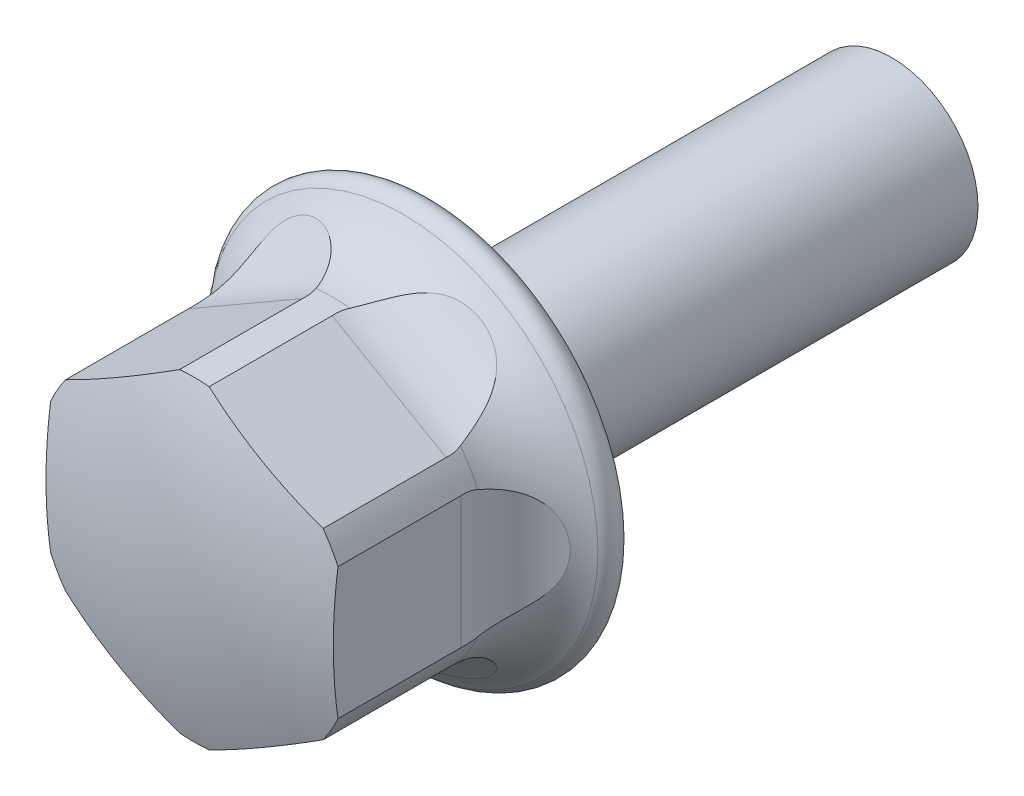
ISO-10303-21;
HEADER;
FILE_DESCRIPTION(('STEP AP214'),'2;1');
FILE_NAME('part.step','',(''),(''),'','','');
FILE_SCHEMA(('AUTOMOTIVE_DESIGN { 1 0 10303 214 1 1 1 1 }'));
ENDSEC;
DATA;
#1=APPLICATION_CONTEXT('core data for automotive mechanical design processes');
#2=APPLICATION_PROTOCOL_DEFINITION('international standard','automotive_design',2000,#1);
#3=PRODUCT_CONTEXT('',#1,'mechanical');
#4=PRODUCT('Part','Part','',(#3));
#5=PRODUCT_RELATED_PRODUCT_CATEGORY('part','',(#4));
#6=PRODUCT_DEFINITION_FORMATION('','',#4);
#7=PRODUCT_DEFINITION_CONTEXT('part definition',#1,'design');
#8=PRODUCT_DEFINITION('design','',#6,#7);
#9=PRODUCT_DEFINITION_SHAPE('','',#8);
#10=(LENGTH_UNIT() NAMED_UNIT(*) SI_UNIT(.MILLI.,.METRE.));
#11=(NAMED_UNIT(*) PLANE_ANGLE_UNIT() SI_UNIT($,.RADIAN.));
#12=(NAMED_UNIT(*) SI_UNIT($,.STERADIAN.) SOLID_ANGLE_UNIT());
#13=UNCERTAINTY_MEASURE_WITH_UNIT(LENGTH_MEASURE(1.E-05),#10,'distance_accuracy_value','');
#14=(GEOMETRIC_REPRESENTATION_CONTEXT(3) GLOBAL_UNCERTAINTY_ASSIGNED_CONTEXT((#13)) GLOBAL_UNIT_ASSIGNED_CONTEXT((#10,
#11,#12)) REPRESENTATION_CONTEXT('',''));
#15=CARTESIAN_POINT('',(0.,0.,0.));
#16=DIRECTION('',(0.,0.,1.));
#17=DIRECTION('',(1.,0.,0.));
#18=AXIS2_PLACEMENT_3D('',#15,#16,#17);
#19=CARTESIAN_POINT('',(0.,0.,0.));
#20=DIRECTION('',(0.,0.,1.));
#21=DIRECTION('',(1.,0.,0.));
#22=AXIS2_PLACEMENT_3D('',#19,#20,#21);
#23=CYLINDRICAL_SURFACE('',#22,5.5);
#24=DIRECTION('',(0.,0.,-1.));
#25=VECTOR('',#24,1.);
#26=CARTESIAN_POINT('',(0.515686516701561,5.47577094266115,14.));
#27=LINE('',#26,#25);
#28=CARTESIAN_POINT('',(0.515686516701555,5.47577094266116,8.27767862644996));
#29=VERTEX_POINT('',#28);
#30=CARTESIAN_POINT('',(0.515686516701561,5.47577094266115,4.));
#31=VERTEX_POINT('',#30);
#32=EDGE_CURVE('E182',#29,#31,#27,.T.);
#33=ORIENTED_EDGE('',*,*,#32,.T.);
#34=CARTESIAN_POINT('',(4.48662747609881,3.18122207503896,3.9));
#35=CARTESIAN_POINT('',(4.48662338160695,3.18123162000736,3.97230895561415));
#36=CARTESIAN_POINT('',(4.48298582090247,3.18637779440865,4.04473759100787));
#37=CARTESIAN_POINT('',(4.46852038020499,3.20662906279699,4.18756027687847));
#38=CARTESIAN_POINT('',(4.4576739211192,3.2217598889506,4.25794857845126));
#39=CARTESIAN_POINT('',(4.42916215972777,3.26084333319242,4.39440914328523));
#40=CARTESIAN_POINT('',(4.41152735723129,3.28475647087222,4.4604991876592));
#41=CARTESIAN_POINT('',(4.36991497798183,3.33991488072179,4.58732240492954));
#42=CARTESIAN_POINT('',(4.34593950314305,3.37115772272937,4.64805734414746));
#43=CARTESIAN_POINT('',(4.2895068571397,3.44273124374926,4.76917083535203));
#44=CARTESIAN_POINT('',(4.25644287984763,3.48365703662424,4.82891182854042));
#45=CARTESIAN_POINT('',(4.18406045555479,3.5702711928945,4.94062349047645));
#46=CARTESIAN_POINT('',(4.14473720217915,3.6159632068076,4.99258812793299));
#47=CARTESIAN_POINT('',(4.03842174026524,3.73502100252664,5.11410395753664));
#48=CARTESIAN_POINT('',(3.96774521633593,3.81031656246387,5.1785560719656));
#49=CARTESIAN_POINT('',(3.81572313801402,3.96256067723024,5.29096292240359));
#50=CARTESIAN_POINT('',(3.73435315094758,4.03951266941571,5.3388789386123));
#51=CARTESIAN_POINT('',(3.59327668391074,4.16459845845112,5.40552940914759));
#52=CARTESIAN_POINT('',(3.53606064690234,4.21331743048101,5.42859441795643));
#53=CARTESIAN_POINT('',(3.4184250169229,4.3093071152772,5.46892892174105));
#54=CARTESIAN_POINT('',(3.35800450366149,4.35657740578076,5.48619674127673));
#55=CARTESIAN_POINT('',(3.2343751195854,4.44913272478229,5.51526793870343));
#56=CARTESIAN_POINT('',(3.17116552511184,4.49441723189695,5.52706988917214));
#57=CARTESIAN_POINT('',(3.0423533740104,4.58259675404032,5.54544354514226));
#58=CARTESIAN_POINT('',(2.97674990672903,4.62549084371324,5.55201323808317));
#59=CARTESIAN_POINT('',(2.77526731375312,4.75111190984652,5.5642013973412));
#60=CARTESIAN_POINT('',(2.63619475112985,4.82966607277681,5.5619617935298));
#61=CARTESIAN_POINT('',(2.35332094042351,4.97363608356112,5.53650211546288));
#62=CARTESIAN_POINT('',(2.20952175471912,5.03905757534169,5.51329107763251));
#63=CARTESIAN_POINT('',(1.94344050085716,5.14688605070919,5.44918857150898));
#64=CARTESIAN_POINT('',(1.8211947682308,5.19127753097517,5.41150356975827));
#65=CARTESIAN_POINT('',(1.58051047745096,5.26952557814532,5.31751550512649));
#66=CARTESIAN_POINT('',(1.46206668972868,5.30339722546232,5.26123933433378));
#67=CARTESIAN_POINT('',(1.263468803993,5.3536329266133,5.14456984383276));
#68=CARTESIAN_POINT('',(1.18118519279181,5.37225786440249,5.08878452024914));
#69=CARTESIAN_POINT('',(1.02542147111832,5.40414631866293,4.96473804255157));
#70=CARTESIAN_POINT('',(0.951929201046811,5.41741730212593,4.89649445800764));
#71=CARTESIAN_POINT('',(0.830491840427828,5.43721886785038,4.7615848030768));
#72=CARTESIAN_POINT('',(0.780340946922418,5.44454721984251,4.69702899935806));
#73=CARTESIAN_POINT('',(0.691060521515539,5.45659848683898,4.56041936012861));
#74=CARTESIAN_POINT('',(0.651926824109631,5.46132238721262,4.4883683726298));
#75=CARTESIAN_POINT('',(0.586847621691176,5.46870222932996,4.33778515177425));
#76=CARTESIAN_POINT('',(0.560994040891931,5.4713438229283,4.25921200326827));
#77=CARTESIAN_POINT('',(0.524778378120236,5.47493857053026,4.09852834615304));
#78=CARTESIAN_POINT('',(0.51440681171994,5.4758927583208,4.0164200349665));
#79=CARTESIAN_POINT('',(0.510192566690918,5.47628504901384,3.86147128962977));
#80=CARTESIAN_POINT('',(0.514551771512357,5.47588804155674,3.7886748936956));
#81=CARTESIAN_POINT('',(0.535646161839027,5.47386466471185,3.64493536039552));
#82=CARTESIAN_POINT('',(0.552379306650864,5.47223849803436,3.57399191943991));
#83=CARTESIAN_POINT('',(0.596800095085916,5.4675689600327,3.43721711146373));
#84=CARTESIAN_POINT('',(0.624271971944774,5.46455330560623,3.37131389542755));
#85=CARTESIAN_POINT('',(0.688759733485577,5.45679952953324,3.24449826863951));
#86=CARTESIAN_POINT('',(0.725777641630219,5.45206104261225,3.18358691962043));
#87=CARTESIAN_POINT('',(0.811879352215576,5.43993723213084,3.0617526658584));
#88=CARTESIAN_POINT('',(0.861803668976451,5.43233310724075,3.00144855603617));
#89=CARTESIAN_POINT('',(0.969092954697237,5.41422476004,2.88840167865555));
#90=CARTESIAN_POINT('',(1.02646285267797,5.40371861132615,2.83566396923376));
#91=CARTESIAN_POINT('',(1.17749954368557,5.37327059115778,2.71266149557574));
#92=CARTESIAN_POINT('',(1.27471038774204,5.3512517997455,2.64724902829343));
#93=CARTESIAN_POINT('',(1.47629007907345,5.29919404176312,2.53248021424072));
#94=CARTESIAN_POINT('',(1.58067500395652,5.26913659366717,2.48316145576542));
#95=CARTESIAN_POINT('',(1.75548646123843,5.21282437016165,2.41374986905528));
#96=CARTESIAN_POINT('',(1.82505409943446,5.18890180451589,2.389463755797));
#97=CARTESIAN_POINT('',(1.96470986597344,5.1376508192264,2.34662742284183));
#98=CARTESIAN_POINT('',(2.03479814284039,5.11032138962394,2.32807890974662));
#99=CARTESIAN_POINT('',(2.24483567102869,5.02330517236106,2.28050091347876));
#100=CARTESIAN_POINT('',(2.38460423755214,4.95857567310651,2.25952132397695));
#101=CARTESIAN_POINT('',(2.66124038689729,4.81585315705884,2.23721912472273));
#102=CARTESIAN_POINT('',(2.79803784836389,4.73768361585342,2.23618206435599));
#103=CARTESIAN_POINT('',(3.06347416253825,4.57052120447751,2.25439226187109));
#104=CARTESIAN_POINT('',(3.19211517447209,4.48153121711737,2.27363412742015));
#105=CARTESIAN_POINT('',(3.42390208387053,4.30645056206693,2.33050687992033));
#106=CARTESIAN_POINT('',(3.52827617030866,4.22121381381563,2.36575502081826));
#107=CARTESIAN_POINT('',(3.72583449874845,4.04787795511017,2.45550119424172));
#108=CARTESIAN_POINT('',(3.81903362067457,3.95978285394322,2.50997323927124));
#109=CARTESIAN_POINT('',(3.96930066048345,3.80827952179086,2.62393742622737));
#110=CARTESIAN_POINT('',(4.02950692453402,3.74433073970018,2.67856506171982));
#111=CARTESIAN_POINT('',(4.14072736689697,3.62094398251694,2.80075843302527));
#112=CARTESIAN_POINT('',(4.19175605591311,3.56149897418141,2.86830338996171));
#113=CARTESIAN_POINT('',(4.27422459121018,3.46184430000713,3.00211864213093));
#114=CARTESIAN_POINT('',(4.30754425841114,3.42013813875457,3.06610794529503));
#115=CARTESIAN_POINT('',(4.36635045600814,3.34473809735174,3.20206320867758));
#116=CARTESIAN_POINT('',(4.39183476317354,3.31104649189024,3.27403142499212));
#117=CARTESIAN_POINT('',(4.43430755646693,3.25395252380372,3.42507769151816));
#118=CARTESIAN_POINT('',(4.45122265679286,3.23063923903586,3.5042105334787));
#119=CARTESIAN_POINT('',(4.47554685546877,3.19686306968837,3.66642758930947));
#120=CARTESIAN_POINT('',(4.48298909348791,3.18635539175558,3.74949696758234));
#121=CARTESIAN_POINT('',(4.48628127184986,3.18170917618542,3.85520785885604));
#122=CARTESIAN_POINT('',(4.48662874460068,3.1812191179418,3.8775981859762));
#123=CARTESIAN_POINT('',(4.48662747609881,3.18122207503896,3.9));
#124=B_SPLINE_CURVE_WITH_KNOTS('',3,(#34,#35,#36,#37,#38,#39,#40,#41,#42,#43,#44,#45,#46,#47,
#48,#49,#50,#51,#52,#53,#54,#55,#56,#57,#58,#59,#60,#61,#62,#63,#64,#65,#66,#67,#68,#69,#70,#71,
#72,#73,#74,#75,#76,#77,#78,#79,#80,#81,#82,#83,#84,#85,#86,#87,#88,#89,#90,#91,#92,#93,#94,#95,
#96,#97,#98,#99,#100,#101,#102,#103,#104,#105,#106,#107,#108,#109,#110,#111,#112,#113,#114,#115,
#116,#117,#118,#119,#120,#121,#122,#123),.UNSPECIFIED.,.T.,.F.,(4,2,2,2,2,2,2,2,2,2,2,2,2,2,2,2,
2,2,2,2,2,2,2,2,2,2,2,2,2,2,2,2,2,2,2,2,2,2,2,2,2,2,2,2,4),(0.,0.216867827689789,
0.434296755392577,0.650759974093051,0.867151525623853,1.10508806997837,1.34320821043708,
1.70640107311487,2.07043868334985,2.30598904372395,2.5416074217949,2.77728729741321,
3.0130577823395,3.49017853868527,3.96709380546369,4.37185029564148,4.77602385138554,
5.07838658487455,5.3803261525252,5.62556584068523,5.87071268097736,6.1175342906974,
6.36420463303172,6.5819058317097,6.79957113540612,7.01307093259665,7.22661602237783,
7.46170492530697,7.69695026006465,8.05264942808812,8.40917351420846,8.641305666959,
8.87350679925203,9.3377550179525,9.80864575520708,10.2794113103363,10.6957596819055,
11.1115473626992,11.4207736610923,11.7295066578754,11.9785171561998,12.227598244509,
12.4787778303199,12.7290762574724,12.7962634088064),.UNSPECIFIED.);
#125=CARTESIAN_POINT('',(0.594175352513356,5.46781086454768,3.44949995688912));
#126=VERTEX_POINT('',#125);
#127=EDGE_CURVE('E665',#31,#126,#124,.T.);
#128=ORIENTED_EDGE('',*,*,#127,.T.);
#129=CARTESIAN_POINT('',(0.,0.,3.44949995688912));
#130=DIRECTION('',(0.,0.,1.));
#131=DIRECTION('',(1.,0.,0.));
#132=AXIS2_PLACEMENT_3D('',#129,#130,#131);
#133=CIRCLE('',#132,5.5);
#134=CARTESIAN_POINT('',(-0.594175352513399,5.46781086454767,3.44949995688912));
#135=VERTEX_POINT('',#134);
#136=EDGE_CURVE('E164',#135,#126,#133,.F.);
#137=ORIENTED_EDGE('',*,*,#136,.F.);
#138=CARTESIAN_POINT('',(-0.511705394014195,5.47614440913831,3.9));
#139=CARTESIAN_POINT('',(-0.511715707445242,5.47614563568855,3.97230895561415));
#140=CARTESIAN_POINT('',(-0.517991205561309,5.47556850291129,4.04473759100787));
#141=CARTESIAN_POINT('',(-0.542762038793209,5.47316669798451,4.18756027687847));
#142=CARTESIAN_POINT('',(-0.561288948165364,5.47133880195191,4.25794857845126));
#143=CARTESIAN_POINT('',(-0.609392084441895,5.4661886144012,4.39440914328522));
#144=CARTESIAN_POINT('',(-0.638918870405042,5.46287299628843,4.46049918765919));
#145=CARTESIAN_POINT('',(-0.707493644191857,5.45441482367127,4.58732240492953));
#146=CARTESIAN_POINT('',(-0.746538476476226,5.44927287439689,4.64805734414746));
#147=CARTESIAN_POINT('',(-0.836739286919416,5.43618752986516,4.76917083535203));
#148=CARTESIAN_POINT('',(-0.888714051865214,5.42801618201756,4.82891182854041));
#149=CARTESIAN_POINT('',(-0.999915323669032,5.40863824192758,4.94062349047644));
#150=CARTESIAN_POINT('',(-1.05914739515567,5.39742931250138,4.99258812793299));
#151=CARTESIAN_POINT('',(-1.21541220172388,5.36488631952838,5.11410395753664));
#152=CARTESIAN_POINT('',(-1.31595833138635,5.34132643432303,5.17855607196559));
#153=CARTESIAN_POINT('',(-1.52381664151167,5.28579350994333,5.29096292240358));
#154=CARTESIAN_POINT('',(-1.63114401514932,5.25380103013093,5.3388789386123));
#155=CARTESIAN_POINT('',(-1.81000971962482,5.19416812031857,5.40552940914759));
#156=CARTESIAN_POINT('',(-1.88080960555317,5.16897706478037,5.42859441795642));
#157=CARTESIAN_POINT('',(-2.02275692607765,5.11509646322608,5.46892892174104));
#158=CARTESIAN_POINT('',(-2.09390445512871,5.08640590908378,5.48619674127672));
#159=CARTESIAN_POINT('',(-2.23587440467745,5.02561738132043,5.51526793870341));
#160=CARTESIAN_POINT('',(-2.30669673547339,4.99351852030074,5.52706988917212));
#161=CARTESIAN_POINT('',(-2.44746851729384,4.92605368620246,5.54544354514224));
#162=CARTESIAN_POINT('',(-2.51741762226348,4.89068646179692,5.55201323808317));
#163=CARTESIAN_POINT('',(-2.72694995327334,4.77900795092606,5.56420139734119));
#164=CARTESIAN_POINT('',(-2.86451613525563,4.69784466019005,5.56196179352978));
#165=CARTESIAN_POINT('',(-3.13063472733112,4.5248537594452,5.53650211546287));
#166=CARTESIAN_POINT('',(-3.25919099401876,4.43303075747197,5.51329107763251));
#167=CARTESIAN_POINT('',(-3.48561381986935,4.25651186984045,5.44918857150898));
#168=CARTESIAN_POINT('',(-3.58518083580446,4.17283970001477,5.41150356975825));
#169=CARTESIAN_POINT('',(-3.77328777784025,4.00352501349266,5.31751550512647));
#170=CARTESIAN_POINT('',(-3.86184337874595,3.91788550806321,5.26123933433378));
#171=CARTESIAN_POINT('',(-4.00464771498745,3.77101254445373,5.14456984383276));
#172=CARTESIAN_POINT('',(-4.06191918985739,3.70906531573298,5.08878452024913));
#173=CARTESIAN_POINT('',(-4.16741726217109,3.59011420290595,4.96473804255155));
#174=CARTESIAN_POINT('',(-4.21565640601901,3.53310352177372,4.89649445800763));
#175=CARTESIAN_POINT('',(-4.29352374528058,3.43783646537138,4.76158480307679));
#176=CARTESIAN_POINT('',(-4.32494573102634,3.39806869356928,4.69702899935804));
#177=CARTESIAN_POINT('',(-4.38002264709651,3.32677521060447,4.5604193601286));
#178=CARTESIAN_POINT('',(-4.40368051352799,3.29524638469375,4.48836837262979));
#179=CARTESIAN_POINT('',(-4.44261124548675,3.24257606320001,4.33778515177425));
#180=CARTESIAN_POINT('',(-4.457825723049,3.22150700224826,4.25921200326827));
#181=CARTESIAN_POINT('',(-4.47904669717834,3.19194069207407,4.09852834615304));
#182=CARTESIAN_POINT('',(-4.48505883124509,3.18343574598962,4.01642003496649));
#183=CARTESIAN_POINT('',(-4.48750568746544,3.17998224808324,3.86147128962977));
#184=CARTESIAN_POINT('',(-4.48498226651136,3.18355892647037,3.7886748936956));
#185=CARTESIAN_POINT('',(-4.47268277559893,3.20081551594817,3.64493536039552));
#186=CARTESIAN_POINT('',(-4.46290790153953,3.21449376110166,3.57399191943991));
#187=CARTESIAN_POINT('',(-4.43665356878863,3.25062852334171,3.43721711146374));
#188=CARTESIAN_POINT('',(-4.42030599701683,3.27291203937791,3.37131389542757));
#189=CARTESIAN_POINT('',(-4.38134714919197,3.32488319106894,3.24449826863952));
#190=CARTESIAN_POINT('',(-4.35873454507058,3.35457239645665,3.18358691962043));
#191=CARTESIAN_POINT('',(-4.30518416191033,3.42307675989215,3.0617526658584));
#192=CARTESIAN_POINT('',(-4.27363663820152,3.46251042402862,3.00144855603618));
#193=CARTESIAN_POINT('',(-4.20430970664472,3.54637149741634,2.88840167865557));
#194=CARTESIAN_POINT('',(-4.16652616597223,3.59080221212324,2.83566396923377));
#195=CARTESIAN_POINT('',(-4.06463906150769,3.70637981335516,2.71266149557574));
#196=CARTESIAN_POINT('',(-3.99696480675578,3.77955747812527,2.64724902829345));
#197=CARTESIAN_POINT('',(-3.85109162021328,3.92810173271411,2.53248021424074));
#198=CARTESIAN_POINT('',(-3.77286864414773,4.00347300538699,2.48316145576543));
#199=CARTESIAN_POINT('',(-3.6366950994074,4.12670805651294,2.41374986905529));
#200=CARTESIAN_POINT('',(-3.58119373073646,4.17499411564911,2.38946375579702));
#201=CARTESIAN_POINT('',(-3.46698119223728,4.27031406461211,2.34662742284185));
#202=CARTESIAN_POINT('',(-3.40826907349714,4.31734757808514,2.32807890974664));
#203=CARTESIAN_POINT('',(-3.22789205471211,4.45573730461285,2.28050091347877));
#204=CARTESIAN_POINT('',(-3.1019503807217,4.54441568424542,2.25952132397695));
#205=CARTESIAN_POINT('',(-2.84003098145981,4.71262835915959,2.23721912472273));
#206=CARTESIAN_POINT('',(-2.70393544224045,4.79201366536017,2.23618206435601));
#207=CARTESIAN_POINT('',(-2.42645039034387,4.93830705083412,2.25439226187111));
#208=CARTESIAN_POINT('',(-2.28506229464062,5.0052184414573,2.27363412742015));
#209=CARTESIAN_POINT('',(-2.01754454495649,5.11841146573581,2.33050687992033));
#210=CARTESIAN_POINT('',(-1.89154031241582,5.16618370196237,2.36575502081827));
#211=CARTESIAN_POINT('',(-1.64264789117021,5.25060630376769,2.45550119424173));
#212=CARTESIAN_POINT('',(-1.51975573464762,5.28727156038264,2.50997323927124));
#213=CARTESIAN_POINT('',(-1.31341648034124,5.34165496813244,2.62393742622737));
#214=CARTESIAN_POINT('',(-1.22793207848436,5.36182073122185,2.67856506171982));
#215=CARTESIAN_POINT('',(-1.0654657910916,5.39644708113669,2.80075843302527));
#216=CARTESIAN_POINT('',(-0.988470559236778,5.41091671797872,2.8683033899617));
#217=CARTESIAN_POINT('',(-0.860932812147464,5.43250922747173,3.00211864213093));
#218=CARTESIAN_POINT('',(-0.808154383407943,5.44051182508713,3.06610794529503));
#219=CARTESIAN_POINT('',(-0.713452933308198,5.45373946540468,3.20206320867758));
#220=CARTESIAN_POINT('',(-0.671532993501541,5.45896372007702,3.27403142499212));
#221=CARTESIAN_POINT('',(-0.600851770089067,5.46719925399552,3.42507769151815));
#222=CARTESIAN_POINT('',(-0.572204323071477,5.47019151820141,3.5042105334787));
#223=CARTESIAN_POINT('',(-0.53079120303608,5.4743688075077,3.66642758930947));
#224=CARTESIAN_POINT('',(-0.517970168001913,5.47556013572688,3.74949696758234));
#225=CARTESIAN_POINT('',(-0.512300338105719,5.47608813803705,3.85520785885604));
#226=CARTESIAN_POINT('',(-0.511702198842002,5.47614402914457,3.8775981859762));
#227=CARTESIAN_POINT('',(-0.511705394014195,5.47614440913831,3.9));
#228=B_SPLINE_CURVE_WITH_KNOTS('',3,(#138,#139,#140,#141,#142,#143,#144,#145,#146,#147,#148,
#149,#150,#151,#152,#153,#154,#155,#156,#157,#158,#159,#160,#161,#162,#163,#164,#165,#166,#167,
#168,#169,#170,#171,#172,#173,#174,#175,#176,#177,#178,#179,#180,#181,#182,#183,#184,#185,#186,
#187,#188,#189,#190,#191,#192,#193,#194,#195,#196,#197,#198,#199,#200,#201,#202,#203,#204,#205,
#206,#207,#208,#209,#210,#211,#212,#213,#214,#215,#216,#217,#218,#219,#220,#221,#222,#223,#224,
#225,#226,#227),.UNSPECIFIED.,.T.,.F.,(4,2,2,2,2,2,2,2,2,2,2,2,2,2,2,2,2,2,2,2,2,2,2,2,2,2,2,2,
2,2,2,2,2,2,2,2,2,2,2,2,2,2,2,2,4),(0.,0.216867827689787,0.434296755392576,0.650759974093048,
0.867151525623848,1.10508806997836,1.34320821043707,1.70640107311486,2.07043868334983,
2.30598904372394,2.54160742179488,2.77728729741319,3.01305778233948,3.49017853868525,
3.96709380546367,4.37185029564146,4.77602385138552,5.07838658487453,5.38032615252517,
5.6255658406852,5.87071268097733,6.11753429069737,6.36420463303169,6.58190583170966,
6.79957113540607,7.0130709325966,7.22661602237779,7.46170492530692,7.6969502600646,
8.05264942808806,8.4091735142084,8.64130566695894,8.87350679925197,9.33775501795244,
9.80864575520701,10.2794113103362,10.6957596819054,11.1115473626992,11.4207736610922,
11.7295066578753,11.9785171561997,12.2275982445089,12.4787778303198,12.7290762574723,
12.7962634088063),.UNSPECIFIED.);
#229=CARTESIAN_POINT('',(-0.515686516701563,5.47577094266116,4.));
#230=VERTEX_POINT('',#229);
#231=EDGE_CURVE('E146',#135,#230,#228,.T.);
#232=ORIENTED_EDGE('',*,*,#231,.T.);
#233=DIRECTION('',(0.,0.,-1.));
#234=VECTOR('',#233,1.);
#235=CARTESIAN_POINT('',(-0.515686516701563,5.47577094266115,14.));
#236=LINE('',#235,#234);
#237=CARTESIAN_POINT('',(-0.515686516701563,5.47577094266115,8.27767862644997));
#238=VERTEX_POINT('',#237);
#239=EDGE_CURVE('E154',#238,#230,#236,.T.);
#240=ORIENTED_EDGE('',*,*,#239,.F.);
#241=CARTESIAN_POINT('',(0.,0.,8.27767862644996));
#242=DIRECTION('',(0.,0.,1.));
#243=DIRECTION('',(1.,0.,0.));
#244=AXIS2_PLACEMENT_3D('',#241,#242,#243);
#245=CIRCLE('',#244,5.5);
#246=EDGE_CURVE('E227',#29,#238,#245,.T.);
#247=ORIENTED_EDGE('',*,*,#246,.F.);
#248=EDGE_LOOP('',(#33,#128,#137,#232,#240,#247));
#249=FACE_BOUND('',#248,.T.);
#250=ADVANCED_FACE('F16',(#249),#23,.T.);
#251=DIRECTION('',(0.,0.,-1.));
#252=VECTOR('',#251,1.);
#253=CARTESIAN_POINT('',(4.48431348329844,-3.18448309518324,14.));
#254=LINE('',#253,#252);
#255=CARTESIAN_POINT('',(4.48431348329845,-3.18448309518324,8.27767862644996));
#256=VERTEX_POINT('',#255);
#257=CARTESIAN_POINT('',(4.48431348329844,-3.18448309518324,4.));
#258=VERTEX_POINT('',#257);
#259=EDGE_CURVE('E32',#256,#258,#254,.T.);
#260=ORIENTED_EDGE('',*,*,#259,.T.);
#261=CARTESIAN_POINT('',(0.511705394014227,-5.47614440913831,3.9));
#262=CARTESIAN_POINT('',(0.511715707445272,-5.47614563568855,3.97230895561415));
#263=CARTESIAN_POINT('',(0.517991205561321,-5.47556850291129,4.04473759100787));
#264=CARTESIAN_POINT('',(0.542762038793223,-5.47316669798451,4.18756027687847));
#265=CARTESIAN_POINT('',(0.561288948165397,-5.47133880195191,4.25794857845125));
#266=CARTESIAN_POINT('',(0.609392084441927,-5.4661886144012,4.39440914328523));
#267=CARTESIAN_POINT('',(0.638918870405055,-5.46287299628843,4.46049918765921));
#268=CARTESIAN_POINT('',(0.707493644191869,-5.45441482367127,4.58732240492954));
#269=CARTESIAN_POINT('',(0.746538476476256,-5.44927287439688,4.64805734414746));
#270=CARTESIAN_POINT('',(0.836739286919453,-5.43618752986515,4.76917083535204));
#271=CARTESIAN_POINT('',(0.888714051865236,-5.42801618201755,4.82891182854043));
#272=CARTESIAN_POINT('',(0.99991532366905,-5.40863824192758,4.94062349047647));
#273=CARTESIAN_POINT('',(1.0591473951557,-5.39742931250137,4.992588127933));
#274=CARTESIAN_POINT('',(1.21541220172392,-5.36488631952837,5.11410395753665));
#275=CARTESIAN_POINT('',(1.31595833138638,-5.34132643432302,5.17855607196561));
#276=CARTESIAN_POINT('',(1.5238166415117,-5.28579350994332,5.2909629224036));
#277=CARTESIAN_POINT('',(1.63114401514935,-5.25380103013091,5.33887893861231));
#278=CARTESIAN_POINT('',(1.81000971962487,-5.19416812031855,5.40552940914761));
#279=CARTESIAN_POINT('',(1.88080960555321,-5.16897706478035,5.42859441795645));
#280=CARTESIAN_POINT('',(2.02275692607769,-5.11509646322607,5.46892892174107));
#281=CARTESIAN_POINT('',(2.09390445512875,-5.08640590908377,5.48619674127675));
#282=CARTESIAN_POINT('',(2.23587440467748,-5.02561738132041,5.51526793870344));
#283=CARTESIAN_POINT('',(2.30669673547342,-4.99351852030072,5.52706988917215));
#284=CARTESIAN_POINT('',(2.44746851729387,-4.92605368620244,5.54544354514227));
#285=CARTESIAN_POINT('',(2.51741762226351,-4.8906864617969,5.55201323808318));
#286=CARTESIAN_POINT('',(2.72694995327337,-4.77900795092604,5.5642013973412));
#287=CARTESIAN_POINT('',(2.86451613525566,-4.69784466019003,5.56196179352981));
#288=CARTESIAN_POINT('',(3.13063472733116,-4.52485375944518,5.53650211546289));
#289=CARTESIAN_POINT('',(3.2591909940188,-4.43303075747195,5.51329107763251));
#290=CARTESIAN_POINT('',(3.48561381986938,-4.25651186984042,5.44918857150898));
#291=CARTESIAN_POINT('',(3.5851808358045,-4.17283970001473,5.41150356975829));
#292=CARTESIAN_POINT('',(3.77328777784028,-4.00352501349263,5.3175155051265));
#293=CARTESIAN_POINT('',(3.86184337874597,-3.91788550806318,5.26123933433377));
#294=CARTESIAN_POINT('',(4.00464771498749,-3.77101254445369,5.14456984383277));
#295=CARTESIAN_POINT('',(4.06191918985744,-3.70906531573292,5.08878452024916));
#296=CARTESIAN_POINT('',(4.16741726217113,-3.5901142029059,4.96473804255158));
#297=CARTESIAN_POINT('',(4.21565640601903,-3.53310352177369,4.89649445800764));
#298=CARTESIAN_POINT('',(4.29352374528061,-3.43783646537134,4.76158480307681));
#299=CARTESIAN_POINT('',(4.32494573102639,-3.39806869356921,4.69702899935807));
#300=CARTESIAN_POINT('',(4.38002264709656,-3.32677521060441,4.56041936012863));
#301=CARTESIAN_POINT('',(4.40368051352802,-3.29524638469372,4.4883683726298));
#302=CARTESIAN_POINT('',(4.44261124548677,-3.24257606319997,4.33778515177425));
#303=CARTESIAN_POINT('',(4.45782572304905,-3.22150700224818,4.25921200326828));
#304=CARTESIAN_POINT('',(4.47904669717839,-3.19194069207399,4.09852834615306));
#305=CARTESIAN_POINT('',(4.48505883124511,-3.18343574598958,4.01642003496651));
#306=CARTESIAN_POINT('',(4.48750568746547,-3.17998224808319,3.86147128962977));
#307=CARTESIAN_POINT('',(4.48498226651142,-3.18355892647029,3.7886748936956));
#308=CARTESIAN_POINT('',(4.47268277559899,-3.20081551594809,3.64493536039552));
#309=CARTESIAN_POINT('',(4.46290790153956,-3.21449376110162,3.57399191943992));
#310=CARTESIAN_POINT('',(4.43665356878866,-3.25062852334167,3.43721711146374));
#311=CARTESIAN_POINT('',(4.42030599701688,-3.27291203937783,3.37131389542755));
#312=CARTESIAN_POINT('',(4.38134714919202,-3.32488319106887,3.24449826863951));
#313=CARTESIAN_POINT('',(4.35873454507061,-3.35457239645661,3.18358691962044));
#314=CARTESIAN_POINT('',(4.30518416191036,-3.42307675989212,3.0617526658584));
#315=CARTESIAN_POINT('',(4.27363663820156,-3.46251042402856,3.00144855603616));
#316=CARTESIAN_POINT('',(4.20430970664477,-3.54637149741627,2.88840167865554));
#317=CARTESIAN_POINT('',(4.16652616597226,-3.5908022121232,2.83566396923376));
#318=CARTESIAN_POINT('',(4.06463906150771,-3.70637981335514,2.71266149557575));
#319=CARTESIAN_POINT('',(3.99696480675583,-3.77955747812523,2.64724902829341));
#320=CARTESIAN_POINT('',(3.85109162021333,-3.92810173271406,2.5324802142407));
#321=CARTESIAN_POINT('',(3.77286864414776,-4.00347300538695,2.48316145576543));
#322=CARTESIAN_POINT('',(3.63669509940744,-4.12670805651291,2.41374986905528));
#323=CARTESIAN_POINT('',(3.5811937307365,-4.17499411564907,2.389463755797));
#324=CARTESIAN_POINT('',(3.46698119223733,-4.27031406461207,2.34662742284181));
#325=CARTESIAN_POINT('',(3.40826907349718,-4.3173475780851,2.3280789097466));
#326=CARTESIAN_POINT('',(3.22789205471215,-4.45573730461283,2.28050091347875));
#327=CARTESIAN_POINT('',(3.10195038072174,-4.5444156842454,2.25952132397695));
#328=CARTESIAN_POINT('',(2.84003098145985,-4.71262835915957,2.23721912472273));
#329=CARTESIAN_POINT('',(2.70393544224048,-4.79201366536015,2.23618206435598));
#330=CARTESIAN_POINT('',(2.4264503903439,-4.9383070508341,2.25439226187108));
#331=CARTESIAN_POINT('',(2.28506229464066,-5.00521844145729,2.27363412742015));
#332=CARTESIAN_POINT('',(2.01754454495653,-5.1184114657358,2.33050687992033));
#333=CARTESIAN_POINT('',(1.89154031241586,-5.16618370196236,2.36575502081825));
#334=CARTESIAN_POINT('',(1.64264789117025,-5.25060630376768,2.4555011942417));
#335=CARTESIAN_POINT('',(1.51975573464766,-5.28727156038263,2.50997323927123));
#336=CARTESIAN_POINT('',(1.31341648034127,-5.34165496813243,2.62393742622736));
#337=CARTESIAN_POINT('',(1.22793207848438,-5.36182073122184,2.6785650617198));
#338=CARTESIAN_POINT('',(1.06546579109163,-5.39644708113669,2.80075843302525));
#339=CARTESIAN_POINT('',(0.988470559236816,-5.41091671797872,2.8683033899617));
#340=CARTESIAN_POINT('',(0.860932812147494,-5.43250922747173,3.00211864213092));
#341=CARTESIAN_POINT('',(0.808154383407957,-5.44051182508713,3.06610794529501));
#342=CARTESIAN_POINT('',(0.713452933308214,-5.45373946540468,3.20206320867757));
#343=CARTESIAN_POINT('',(0.671532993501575,-5.45896372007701,3.27403142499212));
#344=CARTESIAN_POINT('',(0.6008517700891,-5.46719925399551,3.42507769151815));
#345=CARTESIAN_POINT('',(0.572204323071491,-5.47019151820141,3.5042105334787));
#346=CARTESIAN_POINT('',(0.530791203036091,-5.4743688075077,3.66642758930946));
#347=CARTESIAN_POINT('',(0.517970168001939,-5.47556013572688,3.74949696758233));
#348=CARTESIAN_POINT('',(0.512300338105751,-5.47608813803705,3.85520785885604));
#349=CARTESIAN_POINT('',(0.511702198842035,-5.47614402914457,3.8775981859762));
#350=CARTESIAN_POINT('',(0.511705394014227,-5.47614440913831,3.9));
#351=B_SPLINE_CURVE_WITH_KNOTS('',3,(#261,#262,#263,#264,#265,#266,#267,#268,#269,#270,#271,
#272,#273,#274,#275,#276,#277,#278,#279,#280,#281,#282,#283,#284,#285,#286,#287,#288,#289,#290,
#291,#292,#293,#294,#295,#296,#297,#298,#299,#300,#301,#302,#303,#304,#305,#306,#307,#308,#309,
#310,#311,#312,#313,#314,#315,#316,#317,#318,#319,#320,#321,#322,#323,#324,#325,#326,#327,#328,
#329,#330,#331,#332,#333,#334,#335,#336,#337,#338,#339,#340,#341,#342,#343,#344,#345,#346,#347,
#348,#349,#350),.UNSPECIFIED.,.T.,.F.,(4,2,2,2,2,2,2,2,2,2,2,2,2,2,2,2,2,2,2,2,2,2,2,2,2,2,2,2,
2,2,2,2,2,2,2,2,2,2,2,2,2,2,2,2,4),(0.,0.21686782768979,0.43429675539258,0.650759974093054,
0.867151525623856,1.10508806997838,1.34320821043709,1.70640107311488,2.07043868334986,
2.30598904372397,2.54160742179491,2.77728729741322,3.01305778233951,3.49017853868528,
3.9670938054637,4.3718502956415,4.77602385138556,5.07838658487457,5.38032615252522,
5.62556584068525,5.87071268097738,6.11753429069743,6.36420463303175,6.58190583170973,
6.79957113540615,7.01307093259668,7.22661602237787,7.461704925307,7.69695026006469,
8.05264942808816,8.40917351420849,8.64130566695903,8.87350679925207,9.33775501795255,
9.80864575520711,10.2794113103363,10.6957596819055,11.1115473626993,11.4207736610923,
11.7295066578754,11.9785171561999,12.227598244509,12.4787778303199,12.7290762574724,
12.7962634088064),.UNSPECIFIED.);
#352=CARTESIAN_POINT('',(4.4381754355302,-3.24847638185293,3.44949995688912));
#353=VERTEX_POINT('',#352);
#354=EDGE_CURVE('E427',#258,#353,#351,.T.);
#355=ORIENTED_EDGE('',*,*,#354,.T.);
#356=CARTESIAN_POINT('',(5.03235078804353,-2.21933448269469,3.44949995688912));
#357=VERTEX_POINT('',#356);
#358=EDGE_CURVE('E229',#357,#353,#133,.F.);
#359=ORIENTED_EDGE('',*,*,#358,.F.);
#360=CARTESIAN_POINT('',(5.03235078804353,-2.21933448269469,3.44949995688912));
#361=CARTESIAN_POINT('',(5.02725471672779,-2.23088694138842,3.48303900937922));
#362=CARTESIAN_POINT('',(5.0226694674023,-2.24117972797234,3.51707689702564));
#363=CARTESIAN_POINT('',(5.01461214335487,-2.25915113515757,3.58597203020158));
#364=CARTESIAN_POINT('',(5.01114031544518,-2.26682917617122,3.62082945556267));
#365=CARTESIAN_POINT('',(5.00254872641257,-2.28576264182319,3.72617734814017));
#366=CARTESIAN_POINT('',(4.99922832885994,-2.29297197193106,3.79760103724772));
#367=CARTESIAN_POINT('',(4.99775313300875,-2.29618499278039,3.94084733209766));
#368=CARTESIAN_POINT('',(4.99960739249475,-2.29216903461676,4.01267041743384));
#369=CARTESIAN_POINT('',(5.00830270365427,-2.27310593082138,4.15448872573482));
#370=CARTESIAN_POINT('',(5.0151416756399,-2.25806338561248,4.22448469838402));
#371=CARTESIAN_POINT('',(5.03308265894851,-2.21778154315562,4.36040059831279));
#372=CARTESIAN_POINT('',(5.04415875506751,-2.19260418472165,4.42634252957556));
#373=CARTESIAN_POINT('',(5.06960724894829,-2.13310237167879,4.55327211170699));
#374=CARTESIAN_POINT('',(5.08398148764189,-2.09877280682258,4.61425696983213));
#375=CARTESIAN_POINT('',(5.11646702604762,-2.01837003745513,4.73619546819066));
#376=CARTESIAN_POINT('',(5.13480821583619,-1.97146618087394,4.79653718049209));
#377=CARTESIAN_POINT('',(5.17271039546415,-1.86976540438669,4.90966452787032));
#378=CARTESIAN_POINT('',(5.19227200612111,-1.81496444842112,4.9624462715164));
#379=CARTESIAN_POINT('',(5.2413623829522,-1.66931640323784,5.08553623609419));
#380=CARTESIAN_POINT('',(5.27087371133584,-1.57436481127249,5.1510082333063));
#381=CARTESIAN_POINT('',(5.32656656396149,-1.37423821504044,5.26592976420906));
#382=CARTESIAN_POINT('',(5.35274001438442,-1.26903946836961,5.31534087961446));
#383=CARTESIAN_POINT('',(5.39142965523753,-1.08983513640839,5.38493257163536));
#384=CARTESIAN_POINT('',(5.40552580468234,-1.01774244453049,5.4092980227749));
#385=CARTESIAN_POINT('',(5.43103994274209,-0.871395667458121,5.45229764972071));
#386=CARTESIAN_POINT('',(5.44245713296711,-0.797140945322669,5.47093011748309));
#387=CARTESIAN_POINT('',(5.47225553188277,-0.572050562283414,5.5187669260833));
#388=CARTESIAN_POINT('',(5.48619457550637,-0.41883881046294,5.53992918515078));
#389=CARTESIAN_POINT('',(5.50117028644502,-0.108247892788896,5.56263104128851));
#390=CARTESIAN_POINT('',(5.50201810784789,0.04915951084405,5.56388343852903));
#391=CARTESIAN_POINT('',(5.49028127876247,0.36236718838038,5.54614939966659));
#392=CARTESIAN_POINT('',(5.47770001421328,0.518167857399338,5.52716806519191));
#393=CARTESIAN_POINT('',(5.442238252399,0.806688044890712,5.47077792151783));
#394=CARTESIAN_POINT('',(5.4206842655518,0.940024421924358,5.43569732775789));
#395=CARTESIAN_POINT('',(5.36944553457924,1.1984561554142,5.34624557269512));
#396=CARTESIAN_POINT('',(5.33977189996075,1.32356248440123,5.2919007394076));
#397=CARTESIAN_POINT('',(5.28369152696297,1.53002759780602,5.17813041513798));
#398=CARTESIAN_POINT('',(5.25840012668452,1.61437488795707,5.12358634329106));
#399=CARTESIAN_POINT('',(5.2070931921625,1.77287321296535,5.00152261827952));
#400=CARTESIAN_POINT('',(5.18107876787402,1.84703893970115,4.9340220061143));
#401=CARTESIAN_POINT('',(5.1359027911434,1.96872731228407,4.80025346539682));
#402=CARTESIAN_POINT('',(5.11638950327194,2.0186282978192,4.73627637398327));
#403=CARTESIAN_POINT('',(5.0803852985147,2.10760286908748,4.6003644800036));
#404=CARTESIAN_POINT('',(5.06389314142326,2.14668090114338,4.52843296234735));
#405=CARTESIAN_POINT('',(5.03557698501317,2.21229873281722,4.37749833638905));
#406=CARTESIAN_POINT('',(5.02378761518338,2.23874579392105,4.29844784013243));
#407=CARTESIAN_POINT('',(5.00653668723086,2.27707023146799,4.13619368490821));
#408=CARTESIAN_POINT('',(5.00107265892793,2.28895329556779,4.05299166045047));
#409=CARTESIAN_POINT('',(4.99743891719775,2.29686941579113,3.89617290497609));
#410=CARTESIAN_POINT('',(4.99844199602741,2.29469977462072,3.82265954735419));
#411=CARTESIAN_POINT('',(5.00573173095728,2.27875712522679,3.67727453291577));
#412=CARTESIAN_POINT('',(5.01200932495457,2.26500401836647,3.60540027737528));
#413=CARTESIAN_POINT('',(5.02411746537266,2.23792366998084,3.50640204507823));
#414=CARTESIAN_POINT('',(5.02805076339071,2.22907762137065,3.4777558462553));
#415=CARTESIAN_POINT('',(5.03235078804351,2.2193344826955,3.4494999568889));
#416=B_SPLINE_CURVE_WITH_KNOTS('',3,(#360,#361,#362,#363,#364,#365,#366,#367,#368,#369,#370,
#371,#372,#373,#374,#375,#376,#377,#378,#379,#380,#381,#382,#383,#384,#385,#386,#387,#388,#389,
#390,#391,#392,#393,#394,#395,#396,#397,#398,#399,#400,#401,#402,#403,#404,#405,#406,#407,#408,
#409,#410,#411,#412,#413,#414,#415),.UNSPECIFIED.,.F.,.F.,(4,2,2,2,2,2,2,2,2,2,2,2,2,2,2,2,2,2,
2,2,2,2,2,2,2,2,2,4),(0.,0.107455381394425,0.214934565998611,0.429393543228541,
0.644228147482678,0.858973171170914,1.07242523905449,1.28599674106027,1.52090717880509,
1.7559381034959,2.11113326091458,2.46717191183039,2.69907123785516,2.93103958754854,
3.39481532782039,3.86527506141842,4.33561620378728,4.75273555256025,5.16928701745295,
5.47895813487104,5.78817759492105,6.03753841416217,6.28679663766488,6.53785784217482,
6.78882096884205,7.00838009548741,7.2275627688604,7.31819287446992),.UNSPECIFIED.);
#417=CARTESIAN_POINT('',(5.,-2.29128784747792,4.));
#418=VERTEX_POINT('',#417);
#419=EDGE_CURVE('E439',#357,#418,#416,.T.);
#420=ORIENTED_EDGE('',*,*,#419,.T.);
#421=DIRECTION('',(0.,0.,-1.));
#422=VECTOR('',#421,1.);
#423=CARTESIAN_POINT('',(5.,-2.29128784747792,14.));
#424=LINE('',#423,#422);
#425=CARTESIAN_POINT('',(5.,-2.29128784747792,8.27767862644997));
#426=VERTEX_POINT('',#425);
#427=EDGE_CURVE('E493',#426,#418,#424,.T.);
#428=ORIENTED_EDGE('',*,*,#427,.F.);
#429=EDGE_CURVE('E228',#256,#426,#245,.T.);
#430=ORIENTED_EDGE('',*,*,#429,.F.);
#431=EDGE_LOOP('',(#260,#355,#359,#420,#428,#430));
#432=FACE_BOUND('',#431,.T.);
#433=ADVANCED_FACE('F275',(#432),#23,.T.);
#434=CARTESIAN_POINT('',(0.59417535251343,-5.46781086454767,3.44949995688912));
#435=VERTEX_POINT('',#434);
#436=CARTESIAN_POINT('',(-0.594175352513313,-5.46781086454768,3.44949995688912));
#437=VERTEX_POINT('',#436);
#438=EDGE_CURVE('E234',#435,#437,#133,.F.);
#439=ORIENTED_EDGE('',*,*,#438,.F.);
#440=CARTESIAN_POINT('',(0.51568651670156,-5.47577094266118,4.));
#441=VERTEX_POINT('',#440);
#442=EDGE_CURVE('E336',#435,#441,#351,.T.);
#443=ORIENTED_EDGE('',*,*,#442,.T.);
#444=DIRECTION('',(0.,0.,-1.));
#445=VECTOR('',#444,1.);
#446=CARTESIAN_POINT('',(0.51568651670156,-5.47577094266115,14.));
#447=LINE('',#446,#445);
#448=CARTESIAN_POINT('',(0.515686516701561,-5.47577094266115,8.27767862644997));
#449=VERTEX_POINT('',#448);
#450=EDGE_CURVE('E216',#449,#441,#447,.T.);
#451=ORIENTED_EDGE('',*,*,#450,.F.);
#452=CARTESIAN_POINT('',(-0.515686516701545,-5.47577094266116,8.27767862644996));
#453=VERTEX_POINT('',#452);
#454=EDGE_CURVE('E487',#453,#449,#245,.T.);
#455=ORIENTED_EDGE('',*,*,#454,.F.);
#456=DIRECTION('',(0.,0.,-1.));
#457=VECTOR('',#456,1.);
#458=CARTESIAN_POINT('',(-0.515686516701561,-5.47577094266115,14.));
#459=LINE('',#458,#457);
#460=CARTESIAN_POINT('',(-0.515686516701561,-5.47577094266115,4.));
#461=VERTEX_POINT('',#460);
#462=EDGE_CURVE('E40',#453,#461,#459,.T.);
#463=ORIENTED_EDGE('',*,*,#462,.T.);
#464=CARTESIAN_POINT('',(-4.48662747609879,-3.18122207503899,3.9));
#465=CARTESIAN_POINT('',(-4.48662338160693,-3.18123162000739,3.97230895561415));
#466=CARTESIAN_POINT('',(-4.48298582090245,-3.18637779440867,4.04473759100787));
#467=CARTESIAN_POINT('',(-4.46852038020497,-3.20662906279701,4.18756027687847));
#468=CARTESIAN_POINT('',(-4.45767392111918,-3.22175988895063,4.25794857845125));
#469=CARTESIAN_POINT('',(-4.42916215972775,-3.26084333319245,4.39440914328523));
#470=CARTESIAN_POINT('',(-4.41152735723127,-3.28475647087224,4.46049918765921));
#471=CARTESIAN_POINT('',(-4.36991497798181,-3.33991488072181,4.58732240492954));
#472=CARTESIAN_POINT('',(-4.34593950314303,-3.3711577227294,4.64805734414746));
#473=CARTESIAN_POINT('',(-4.28950685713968,-3.44273124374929,4.76917083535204));
#474=CARTESIAN_POINT('',(-4.25644287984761,-3.48365703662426,4.82891182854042));
#475=CARTESIAN_POINT('',(-4.18406045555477,-3.57027119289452,4.94062349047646));
#476=CARTESIAN_POINT('',(-4.14473720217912,-3.61596320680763,4.992588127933));
#477=CARTESIAN_POINT('',(-4.03842174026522,-3.73502100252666,5.11410395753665));
#478=CARTESIAN_POINT('',(-3.96774521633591,-3.81031656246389,5.17855607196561));
#479=CARTESIAN_POINT('',(-3.81572313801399,-3.96256067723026,5.2909629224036));
#480=CARTESIAN_POINT('',(-3.73435315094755,-4.03951266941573,5.3388789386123));
#481=CARTESIAN_POINT('',(-3.59327668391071,-4.16459845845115,5.4055294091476));
#482=CARTESIAN_POINT('',(-3.53606064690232,-4.21331743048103,5.42859441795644));
#483=CARTESIAN_POINT('',(-3.41842501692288,-4.30930711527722,5.46892892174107));
#484=CARTESIAN_POINT('',(-3.35800450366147,-4.35657740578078,5.48619674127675));
#485=CARTESIAN_POINT('',(-3.23437511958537,-4.4491327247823,5.51526793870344));
#486=CARTESIAN_POINT('',(-3.17116552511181,-4.49441723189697,5.52706988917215));
#487=CARTESIAN_POINT('',(-3.04235337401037,-4.58259675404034,5.54544354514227));
#488=CARTESIAN_POINT('',(-2.97674990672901,-4.62549084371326,5.55201323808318));
#489=CARTESIAN_POINT('',(-2.7752673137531,-4.75111190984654,5.5642013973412));
#490=CARTESIAN_POINT('',(-2.63619475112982,-4.82966607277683,5.56196179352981));
#491=CARTESIAN_POINT('',(-2.35332094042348,-4.97363608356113,5.53650211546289));
#492=CARTESIAN_POINT('',(-2.2095217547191,-5.0390575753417,5.51329107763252));
#493=CARTESIAN_POINT('',(-1.94344050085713,-5.1468860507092,5.44918857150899));
#494=CARTESIAN_POINT('',(-1.82119476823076,-5.19127753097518,5.41150356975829));
#495=CARTESIAN_POINT('',(-1.58051047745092,-5.26952557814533,5.3175155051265));
#496=CARTESIAN_POINT('',(-1.46206668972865,-5.30339722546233,5.26123933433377));
#497=CARTESIAN_POINT('',(-1.26346880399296,-5.35363292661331,5.14456984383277));
#498=CARTESIAN_POINT('',(-1.18118519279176,-5.3722578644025,5.08878452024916));
#499=CARTESIAN_POINT('',(-1.02542147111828,-5.40414631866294,4.96473804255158));
#500=CARTESIAN_POINT('',(-0.951929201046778,-5.41741730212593,4.89649445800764));
#501=CARTESIAN_POINT('',(-0.830491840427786,-5.43721886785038,4.76158480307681));
#502=CARTESIAN_POINT('',(-0.780340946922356,-5.44454721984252,4.69702899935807));
#503=CARTESIAN_POINT('',(-0.691060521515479,-5.45659848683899,4.56041936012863));
#504=CARTESIAN_POINT('',(-0.651926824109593,-5.46132238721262,4.4883683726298));
#505=CARTESIAN_POINT('',(-0.586847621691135,-5.46870222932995,4.33778515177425));
#506=CARTESIAN_POINT('',(-0.560994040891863,-5.47134382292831,4.25921200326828));
#507=CARTESIAN_POINT('',(-0.524778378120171,-5.47493857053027,4.09852834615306));
#508=CARTESIAN_POINT('',(-0.514406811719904,-5.4758927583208,4.01642003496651));
#509=CARTESIAN_POINT('',(-0.510192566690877,-5.47628504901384,3.86147128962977));
#510=CARTESIAN_POINT('',(-0.51455177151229,-5.47588804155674,3.7886748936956));
#511=CARTESIAN_POINT('',(-0.535646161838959,-5.47386466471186,3.64493536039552));
#512=CARTESIAN_POINT('',(-0.55237930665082,-5.47223849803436,3.57399191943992));
#513=CARTESIAN_POINT('',(-0.596800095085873,-5.4675689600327,3.43721711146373));
#514=CARTESIAN_POINT('',(-0.624271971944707,-5.46455330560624,3.37131389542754));
#515=CARTESIAN_POINT('',(-0.688759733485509,-5.45679952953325,3.24449826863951));
#516=CARTESIAN_POINT('',(-0.725777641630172,-5.45206104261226,3.18358691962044));
#517=CARTESIAN_POINT('',(-0.811879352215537,-5.43993723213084,3.0617526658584));
#518=CARTESIAN_POINT('',(-0.861803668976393,-5.43233310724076,3.00144855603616));
#519=CARTESIAN_POINT('',(-0.969092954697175,-5.41422476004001,2.88840167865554));
#520=CARTESIAN_POINT('',(-1.02646285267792,-5.40371861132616,2.83566396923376));
#521=CARTESIAN_POINT('',(-1.17749954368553,-5.37327059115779,2.71266149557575));
#522=CARTESIAN_POINT('',(-1.27471038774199,-5.35125179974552,2.64724902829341));
#523=CARTESIAN_POINT('',(-1.47629007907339,-5.29919404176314,2.5324802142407));
#524=CARTESIAN_POINT('',(-1.58067500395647,-5.26913659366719,2.48316145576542));
#525=CARTESIAN_POINT('',(-1.75548646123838,-5.21282437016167,2.41374986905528));
#526=CARTESIAN_POINT('',(-1.82505409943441,-5.18890180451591,2.389463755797));
#527=CARTESIAN_POINT('',(-1.96470986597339,-5.13765081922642,2.34662742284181));
#528=CARTESIAN_POINT('',(-2.03479814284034,-5.11032138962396,2.3280789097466));
#529=CARTESIAN_POINT('',(-2.24483567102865,-5.02330517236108,2.28050091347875));
#530=CARTESIAN_POINT('',(-2.3846042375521,-4.95857567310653,2.25952132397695));
#531=CARTESIAN_POINT('',(-2.66124038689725,-4.81585315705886,2.23721912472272));
#532=CARTESIAN_POINT('',(-2.79803784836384,-4.73768361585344,2.23618206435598));
#533=CARTESIAN_POINT('',(-3.0634741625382,-4.57052120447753,2.25439226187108));
#534=CARTESIAN_POINT('',(-3.19211517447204,-4.4815312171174,2.27363412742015));
#535=CARTESIAN_POINT('',(-3.42390208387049,-4.30645056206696,2.33050687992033));
#536=CARTESIAN_POINT('',(-3.52827617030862,-4.22121381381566,2.36575502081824));
#537=CARTESIAN_POINT('',(-3.72583449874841,-4.0478779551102,2.4555011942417));
#538=CARTESIAN_POINT('',(-3.81903362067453,-3.95978285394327,2.50997323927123));
#539=CARTESIAN_POINT('',(-3.96930066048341,-3.80827952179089,2.62393742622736));
#540=CARTESIAN_POINT('',(-4.02950692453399,-3.74433073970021,2.6785650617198));
#541=CARTESIAN_POINT('',(-4.14072736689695,-3.62094398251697,2.80075843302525));
#542=CARTESIAN_POINT('',(-4.19175605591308,-3.56149897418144,2.8683033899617));
#543=CARTESIAN_POINT('',(-4.27422459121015,-3.46184430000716,3.00211864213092));
#544=CARTESIAN_POINT('',(-4.30754425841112,-3.42013813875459,3.06610794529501));
#545=CARTESIAN_POINT('',(-4.36635045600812,-3.34473809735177,3.20206320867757));
#546=CARTESIAN_POINT('',(-4.39183476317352,-3.31104649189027,3.27403142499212));
#547=CARTESIAN_POINT('',(-4.43430755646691,-3.25395252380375,3.42507769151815));
#548=CARTESIAN_POINT('',(-4.45122265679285,-3.23063923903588,3.5042105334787));
#549=CARTESIAN_POINT('',(-4.47554685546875,-3.19686306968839,3.66642758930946));
#550=CARTESIAN_POINT('',(-4.4829890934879,-3.18635539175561,3.74949696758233));
#551=CARTESIAN_POINT('',(-4.48628127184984,-3.18170917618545,3.85520785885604));
#552=CARTESIAN_POINT('',(-4.48662874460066,-3.18121911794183,3.8775981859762));
#553=CARTESIAN_POINT('',(-4.48662747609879,-3.18122207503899,3.9));
#554=B_SPLINE_CURVE_WITH_KNOTS('',3,(#464,#465,#466,#467,#468,#469,#470,#471,#472,#473,#474,
#475,#476,#477,#478,#479,#480,#481,#482,#483,#484,#485,#486,#487,#488,#489,#490,#491,#492,#493,
#494,#495,#496,#497,#498,#499,#500,#501,#502,#503,#504,#505,#506,#507,#508,#509,#510,#511,#512,
#513,#514,#515,#516,#517,#518,#519,#520,#521,#522,#523,#524,#525,#526,#527,#528,#529,#530,#531,
#532,#533,#534,#535,#536,#537,#538,#539,#540,#541,#542,#543,#544,#545,#546,#547,#548,#549,#550,
#551,#552,#553),.UNSPECIFIED.,.T.,.F.,(4,2,2,2,2,2,2,2,2,2,2,2,2,2,2,2,2,2,2,2,2,2,2,2,2,2,2,2,
2,2,2,2,2,2,2,2,2,2,2,2,2,2,2,2,4),(0.,0.21686782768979,0.43429675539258,0.650759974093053,
0.867151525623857,1.10508806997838,1.34320821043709,1.70640107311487,2.07043868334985,
2.30598904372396,2.5416074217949,2.77728729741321,3.0130577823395,3.49017853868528,
3.96709380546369,4.37185029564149,4.77602385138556,5.07838658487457,5.38032615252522,
5.62556584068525,5.87071268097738,6.11753429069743,6.36420463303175,6.58190583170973,
6.79957113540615,7.01307093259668,7.22661602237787,7.461704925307,7.69695026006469,
8.05264942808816,8.40917351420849,8.64130566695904,8.87350679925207,9.33775501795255,
9.80864575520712,10.2794113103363,10.6957596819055,11.1115473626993,11.4207736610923,
11.7295066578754,11.9785171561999,12.227598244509,12.4787778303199,12.7290762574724,
12.7962634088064),.UNSPECIFIED.);
#555=EDGE_CURVE('E337',#461,#437,#554,.T.);
#556=ORIENTED_EDGE('',*,*,#555,.T.);
#557=EDGE_LOOP('',(#439,#443,#451,#455,#463,#556));
#558=FACE_BOUND('',#557,.T.);
#559=ADVANCED_FACE('F282',(#558),#23,.T.);
#560=CARTESIAN_POINT('',(-5.03235078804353,2.21933448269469,3.44949995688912));
#561=VERTEX_POINT('',#560);
#562=CARTESIAN_POINT('',(-4.43817543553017,3.24847638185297,3.44949995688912));
#563=VERTEX_POINT('',#562);
#564=EDGE_CURVE('E312',#561,#563,#133,.F.);
#565=ORIENTED_EDGE('',*,*,#564,.F.);
#566=CARTESIAN_POINT('',(-5.5,0.,2.23917705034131));
#567=CARTESIAN_POINT('',(-5.49999788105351,0.152574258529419,2.23917157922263));
#568=CARTESIAN_POINT('',(-5.49361945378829,0.305182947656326,2.24866024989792));
#569=CARTESIAN_POINT('',(-5.4684728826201,0.60724866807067,2.28743553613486));
#570=CARTESIAN_POINT('',(-5.44968246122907,0.75669953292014,2.31675775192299));
#571=CARTESIAN_POINT('',(-5.41331002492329,0.975531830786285,2.37744044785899));
#572=CARTESIAN_POINT('',(-5.39973451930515,1.04792629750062,2.40060633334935));
#573=CARTESIAN_POINT('',(-5.37020046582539,1.19004162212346,2.45299151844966));
#574=CARTESIAN_POINT('',(-5.35424138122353,1.25976187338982,2.48221218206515));
#575=CARTESIAN_POINT('',(-5.32049281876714,1.39543111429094,2.54703977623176));
#576=CARTESIAN_POINT('',(-5.30270950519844,1.46139170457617,2.58262548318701));
#577=CARTESIAN_POINT('',(-5.26596077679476,1.58872443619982,2.66064510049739));
#578=CARTESIAN_POINT('',(-5.24699634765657,1.65010031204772,2.70307334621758));
#579=CARTESIAN_POINT('',(-5.20536698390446,1.77746658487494,2.80328584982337));
#580=CARTESIAN_POINT('',(-5.18263907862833,1.84236295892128,2.86245862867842));
#581=CARTESIAN_POINT('',(-5.13858657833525,1.96188478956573,2.99090841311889));
#582=CARTESIAN_POINT('',(-5.1172613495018,2.01651490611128,3.06018080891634));
#583=CARTESIAN_POINT('',(-5.07800622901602,2.11343902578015,3.20887841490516));
#584=CARTESIAN_POINT('',(-5.06011148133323,2.15560751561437,3.28839605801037));
#585=CARTESIAN_POINT('',(-5.03032163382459,2.22425087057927,3.45499792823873));
#586=CARTESIAN_POINT('',(-5.0184197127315,2.25074358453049,3.54207341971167));
#587=CARTESIAN_POINT('',(-5.00356506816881,2.28355137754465,3.70714678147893));
#588=CARTESIAN_POINT('',(-4.99954631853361,2.29227755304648,3.78457391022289));
#589=CARTESIAN_POINT('',(-4.99759536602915,2.29653036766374,3.93985414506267));
#590=CARTESIAN_POINT('',(-4.99966017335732,2.29206349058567,4.01770702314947));
#591=CARTESIAN_POINT('',(-5.00917559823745,2.27118205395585,4.16430874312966));
#592=CARTESIAN_POINT('',(-5.01613065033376,2.25586593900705,4.23325127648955));
#593=CARTESIAN_POINT('',(-5.03421079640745,2.21522305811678,4.36751547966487));
#594=CARTESIAN_POINT('',(-5.04533587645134,2.18989632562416,4.43283716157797));
#595=CARTESIAN_POINT('',(-5.07138508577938,2.12889498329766,4.56142352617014));
#596=CARTESIAN_POINT('',(-5.08646023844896,2.09279851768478,4.62445592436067));
#597=CARTESIAN_POINT('',(-5.11889016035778,2.01217690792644,4.74419528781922));
#598=CARTESIAN_POINT('',(-5.13624614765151,1.96764725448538,4.80089884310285));
#599=CARTESIAN_POINT('',(-5.17972889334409,1.85087584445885,4.93051090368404));
#600=CARTESIAN_POINT('',(-5.20642076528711,1.77494659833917,4.9999178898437));
#601=CARTESIAN_POINT('',(-5.25905443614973,1.6123574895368,5.12514797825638));
#602=CARTESIAN_POINT('',(-5.28499450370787,1.52567496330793,5.18094162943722));
#603=CARTESIAN_POINT('',(-5.34184335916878,1.31531108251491,5.29586348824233));
#604=CARTESIAN_POINT('',(-5.37164358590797,1.18873415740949,5.3502280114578));
#605=CARTESIAN_POINT('',(-5.42289288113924,0.92739027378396,5.4393958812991));
#606=CARTESIAN_POINT('',(-5.44433540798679,0.792616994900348,5.47418391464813));
#607=CARTESIAN_POINT('',(-5.47757957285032,0.51573387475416,5.52689478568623));
#608=CARTESIAN_POINT('',(-5.48916847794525,0.373529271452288,5.54444669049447));
#609=CARTESIAN_POINT('',(-5.50116747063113,0.0874650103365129,5.56261575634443));
#610=CARTESIAN_POINT('',(-5.50157017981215,-0.0563956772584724,5.56322173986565));
#611=CARTESIAN_POINT('',(-5.49332464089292,-0.283769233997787,5.55073919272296));
#612=CARTESIAN_POINT('',(-5.48833045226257,-0.367769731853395,5.54317998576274));
#613=CARTESIAN_POINT('',(-5.47458382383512,-0.534732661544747,5.52199170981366));
#614=CARTESIAN_POINT('',(-5.4658304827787,-0.61769483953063,5.50836118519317));
#615=CARTESIAN_POINT('',(-5.44478006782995,-0.781797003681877,5.47472577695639));
#616=CARTESIAN_POINT('',(-5.43248593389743,-0.862938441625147,5.45472618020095));
#617=CARTESIAN_POINT('',(-5.404701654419,-1.02262915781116,5.40791731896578));
#618=CARTESIAN_POINT('',(-5.38921309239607,-1.10117969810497,5.38111142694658));
#619=CARTESIAN_POINT('',(-5.34946029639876,-1.28244625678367,5.30916282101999));
#620=CARTESIAN_POINT('',(-5.32404252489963,-1.38370375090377,5.26089225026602));
#621=CARTESIAN_POINT('',(-5.27013288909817,-1.57660829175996,5.14929899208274));
#622=CARTESIAN_POINT('',(-5.24164639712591,-1.6682715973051,5.08600238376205));
#623=CARTESIAN_POINT('',(-5.19063859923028,-1.81996282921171,4.9585338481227));
#624=CARTESIAN_POINT('',(-5.1681417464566,-1.88256724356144,4.8974319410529));
#625=CARTESIAN_POINT('',(-5.12499103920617,-1.9970483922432,4.76528432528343));
#626=CARTESIAN_POINT('',(-5.10433525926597,-2.04893641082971,4.69424920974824));
#627=CARTESIAN_POINT('',(-5.06994639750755,-2.13245628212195,4.55488476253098));
#628=CARTESIAN_POINT('',(-5.05563675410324,-2.16597962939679,4.48783528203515));
#629=CARTESIAN_POINT('',(-5.03121805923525,-2.22211334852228,4.34856947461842));
#630=CARTESIAN_POINT('',(-5.02110729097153,-2.24472818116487,4.27635527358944));
#631=CARTESIAN_POINT('',(-5.00610877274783,-2.27798539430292,4.12835176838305));
#632=CARTESIAN_POINT('',(-5.00124265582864,-2.28857819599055,4.05254899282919));
#633=CARTESIAN_POINT('',(-4.99736488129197,-2.29703488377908,3.90008715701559));
#634=CARTESIAN_POINT('',(-4.99835211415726,-2.29490118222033,3.82342826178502));
#635=CARTESIAN_POINT('',(-5.00577887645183,-2.27864939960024,3.67731331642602));
#636=CARTESIAN_POINT('',(-5.01181991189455,-2.26540703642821,3.60773661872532));
#637=CARTESIAN_POINT('',(-5.02824689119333,-2.22870673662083,3.47189604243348));
#638=CARTESIAN_POINT('',(-5.03863286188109,-2.20524873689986,3.40563218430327));
#639=CARTESIAN_POINT('',(-5.06325335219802,-2.1481287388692,3.27562754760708));
#640=CARTESIAN_POINT('',(-5.07760882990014,-2.11414112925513,3.21205392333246));
#641=CARTESIAN_POINT('',(-5.10879867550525,-2.03761779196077,3.09098273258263));
#642=CARTESIAN_POINT('',(-5.12563423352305,-1.99507795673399,3.03348810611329));
#643=CARTESIAN_POINT('',(-5.16778130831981,-1.88383744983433,2.90278210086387));
#644=CARTESIAN_POINT('',(-5.19373517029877,-1.81156627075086,2.83280785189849));
#645=CARTESIAN_POINT('',(-5.24534854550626,-1.6562185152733,2.70593539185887));
#646=CARTESIAN_POINT('',(-5.27100731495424,-1.57311927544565,2.64906531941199));
#647=CARTESIAN_POINT('',(-5.32774874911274,-1.37089028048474,2.5312171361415));
#648=CARTESIAN_POINT('',(-5.35789738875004,-1.2488065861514,2.47487161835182));
#649=CARTESIAN_POINT('',(-5.41059217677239,-0.996106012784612,2.38129179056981));
#650=CARTESIAN_POINT('',(-5.43313292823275,-0.865483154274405,2.34407103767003));
#651=CARTESIAN_POINT('',(-5.46707762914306,-0.612890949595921,2.28951766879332));
#652=CARTESIAN_POINT('',(-5.47937831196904,-0.491385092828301,2.27055255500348));
#653=CARTESIAN_POINT('',(-5.49583868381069,-0.246593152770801,2.24538707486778));
#654=CARTESIAN_POINT('',(-5.50000171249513,-0.123307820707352,2.23918147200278));
#655=CARTESIAN_POINT('',(-5.5,0.,2.23917705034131));
#656=B_SPLINE_CURVE_WITH_KNOTS('',3,(#566,#567,#568,#569,#570,#571,#572,#573,#574,#575,#576,
#577,#578,#579,#580,#581,#582,#583,#584,#585,#586,#587,#588,#589,#590,#591,#592,#593,#594,#595,
#596,#597,#598,#599,#600,#601,#602,#603,#604,#605,#606,#607,#608,#609,#610,#611,#612,#613,#614,
#615,#616,#617,#618,#619,#620,#621,#622,#623,#624,#625,#626,#627,#628,#629,#630,#631,#632,#633,
#634,#635,#636,#637,#638,#639,#640,#641,#642,#643,#644,#645,#646,#647,#648,#649,#650,#651,#652,
#653,#654,#655),.UNSPECIFIED.,.T.,.F.,(4,2,2,2,2,2,2,2,2,2,2,2,2,2,2,2,2,2,2,2,2,2,2,2,2,2,2,2,
2,2,2,2,2,2,2,2,2,2,2,2,2,2,2,2,4),(0.,0.457384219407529,0.91559160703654,1.14697191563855,
1.37840440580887,1.6090791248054,1.83956384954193,2.11068163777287,2.3816760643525,
2.65531355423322,2.9286388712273,3.16139887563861,3.39404450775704,3.60598981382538,
3.81793441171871,4.03961378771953,4.26141203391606,4.57848235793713,4.89623266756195,
5.31680896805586,5.73771379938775,6.16749029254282,6.59755025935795,6.85074993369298,
7.10401034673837,7.35706107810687,7.60998666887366,7.9537929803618,8.29700689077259,
8.5669700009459,8.83664737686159,9.0646278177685,9.29251495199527,9.52133851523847,
9.75011870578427,9.96239356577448,10.1746697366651,10.3943063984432,10.6140488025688,
10.9239984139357,11.2346075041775,11.6457932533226,12.0572700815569,12.4270717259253,
12.7967215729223),.UNSPECIFIED.);
#657=CARTESIAN_POINT('',(-5.,2.29128784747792,4.));
#658=VERTEX_POINT('',#657);
#659=EDGE_CURVE('E389',#561,#658,#656,.T.);
#660=ORIENTED_EDGE('',*,*,#659,.T.);
#661=DIRECTION('',(0.,0.,-1.));
#662=VECTOR('',#661,1.);
#663=CARTESIAN_POINT('',(-5.,2.29128784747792,14.));
#664=LINE('',#663,#662);
#665=CARTESIAN_POINT('',(-5.,2.29128784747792,8.27767862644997));
#666=VERTEX_POINT('',#665);
#667=EDGE_CURVE('E198',#666,#658,#664,.T.);
#668=ORIENTED_EDGE('',*,*,#667,.F.);
#669=CARTESIAN_POINT('',(-4.48431348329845,3.18448309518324,8.27767862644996));
#670=VERTEX_POINT('',#669);
#671=EDGE_CURVE('E486',#670,#666,#245,.T.);
#672=ORIENTED_EDGE('',*,*,#671,.F.);
#673=DIRECTION('',(0.,0.,-1.));
#674=VECTOR('',#673,1.);
#675=CARTESIAN_POINT('',(-4.48431348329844,3.18448309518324,14.));
#676=LINE('',#675,#674);
#677=CARTESIAN_POINT('',(-4.48431348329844,3.18448309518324,4.));
#678=VERTEX_POINT('',#677);
#679=EDGE_CURVE('E172',#670,#678,#676,.T.);
#680=ORIENTED_EDGE('',*,*,#679,.T.);
#681=EDGE_CURVE('E149',#678,#563,#228,.T.);
#682=ORIENTED_EDGE('',*,*,#681,.T.);
#683=EDGE_LOOP('',(#565,#660,#668,#672,#680,#682));
#684=FACE_BOUND('',#683,.T.);
#685=ADVANCED_FACE('F296',(#684),#23,.T.);
#686=CARTESIAN_POINT('',(-4.43817543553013,-3.24847638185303,3.44949995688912));
#687=VERTEX_POINT('',#686);
#688=CARTESIAN_POINT('',(-5.03235078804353,-2.21933448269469,3.44949995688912));
#689=VERTEX_POINT('',#688);
#690=EDGE_CURVE('E315',#687,#689,#133,.F.);
#691=ORIENTED_EDGE('',*,*,#690,.F.);
#692=CARTESIAN_POINT('',(-4.48431348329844,-3.18448309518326,4.));
#693=VERTEX_POINT('',#692);
#694=EDGE_CURVE('E341',#687,#693,#554,.T.);
#695=ORIENTED_EDGE('',*,*,#694,.T.);
#696=DIRECTION('',(0.,0.,-1.));
#697=VECTOR('',#696,1.);
#698=CARTESIAN_POINT('',(-4.48431348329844,-3.18448309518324,14.));
#699=LINE('',#698,#697);
#700=CARTESIAN_POINT('',(-4.48431348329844,-3.18448309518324,8.27767862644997));
#701=VERTEX_POINT('',#700);
#702=EDGE_CURVE('E207',#701,#693,#699,.T.);
#703=ORIENTED_EDGE('',*,*,#702,.F.);
#704=CARTESIAN_POINT('',(-5.,-2.29128784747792,8.27767862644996));
#705=VERTEX_POINT('',#704);
#706=EDGE_CURVE('E482',#705,#701,#245,.T.);
#707=ORIENTED_EDGE('',*,*,#706,.F.);
#708=DIRECTION('',(0.,0.,-1.));
#709=VECTOR('',#708,1.);
#710=CARTESIAN_POINT('',(-5.,-2.29128784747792,14.));
#711=LINE('',#710,#709);
#712=CARTESIAN_POINT('',(-5.,-2.29128784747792,4.));
#713=VERTEX_POINT('',#712);
#714=EDGE_CURVE('E194',#705,#713,#711,.T.);
#715=ORIENTED_EDGE('',*,*,#714,.T.);
#716=EDGE_CURVE('E345',#713,#689,#656,.T.);
#717=ORIENTED_EDGE('',*,*,#716,.T.);
#718=EDGE_LOOP('',(#691,#695,#703,#707,#715,#717));
#719=FACE_BOUND('',#718,.T.);
#720=ADVANCED_FACE('F288',(#719),#23,.T.);
#721=CARTESIAN_POINT('',(4.43817543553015,3.248476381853,3.44949995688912));
#722=VERTEX_POINT('',#721);
#723=CARTESIAN_POINT('',(5.03235078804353,2.21933448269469,3.44949995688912));
#724=VERTEX_POINT('',#723);
#725=EDGE_CURVE('E226',#722,#724,#133,.F.);
#726=ORIENTED_EDGE('',*,*,#725,.F.);
#727=CARTESIAN_POINT('',(4.48431348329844,3.18448309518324,4.));
#728=VERTEX_POINT('',#727);
#729=EDGE_CURVE('E302',#722,#728,#124,.T.);
#730=ORIENTED_EDGE('',*,*,#729,.T.);
#731=DIRECTION('',(0.,0.,-1.));
#732=VECTOR('',#731,1.);
#733=CARTESIAN_POINT('',(4.48431348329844,3.18448309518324,14.));
#734=LINE('',#733,#732);
#735=CARTESIAN_POINT('',(4.48431348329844,3.18448309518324,8.27767862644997));
#736=VERTEX_POINT('',#735);
#737=EDGE_CURVE('E185',#736,#728,#734,.T.);
#738=ORIENTED_EDGE('',*,*,#737,.F.);
#739=CARTESIAN_POINT('',(5.,2.29128784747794,8.27767862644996));
#740=VERTEX_POINT('',#739);
#741=EDGE_CURVE('E222',#740,#736,#245,.T.);
#742=ORIENTED_EDGE('',*,*,#741,.F.);
#743=DIRECTION('',(0.,0.,-1.));
#744=VECTOR('',#743,1.);
#745=CARTESIAN_POINT('',(5.,2.29128784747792,14.));
#746=LINE('',#745,#744);
#747=CARTESIAN_POINT('',(5.,2.29128784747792,4.));
#748=VERTEX_POINT('',#747);
#749=EDGE_CURVE('E491',#740,#748,#746,.T.);
#750=ORIENTED_EDGE('',*,*,#749,.T.);
#751=EDGE_CURVE('E304',#748,#724,#416,.T.);
#752=ORIENTED_EDGE('',*,*,#751,.T.);
#753=EDGE_LOOP('',(#726,#730,#738,#742,#750,#752));
#754=FACE_BOUND('',#753,.T.);
#755=ADVANCED_FACE('F277',(#754),#23,.T.);
#756=CARTESIAN_POINT('',(0.,0.,-7.66));
#757=DIRECTION('',(0.,0.,1.));
#758=DIRECTION('',(-1.,0.,0.));
#759=AXIS2_PLACEMENT_3D('',#756,#757,#758);
#760=SPHERICAL_SURFACE('',#759,16.86);
#761=CARTESIAN_POINT('',(5.,0.,-7.66));
#762=DIRECTION('',(1.,0.,0.));
#763=DIRECTION('',(0.,0.,-1.));
#764=AXIS2_PLACEMENT_3D('',#761,#762,#763);
#765=CIRCLE('',#764,16.10154029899);
#766=EDGE_CURVE('E248',#740,#426,#765,.T.);
#767=ORIENTED_EDGE('',*,*,#766,.F.);
#768=ORIENTED_EDGE('',*,*,#741,.T.);
#769=CARTESIAN_POINT('',(2.5,4.3301270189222,-7.66));
#770=DIRECTION('',(0.5,0.866025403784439,0.));
#771=DIRECTION('',(-0.866025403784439,0.5,0.));
#772=AXIS2_PLACEMENT_3D('',#769,#770,#771);
#773=CIRCLE('',#772,16.10154029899);
#774=EDGE_CURVE('E233',#29,#736,#773,.T.);
#775=ORIENTED_EDGE('',*,*,#774,.F.);
#776=ORIENTED_EDGE('',*,*,#246,.T.);
#777=CARTESIAN_POINT('',(-2.5,4.3301270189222,-7.66));
#778=DIRECTION('',(-0.5,0.866025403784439,0.));
#779=DIRECTION('',(-0.866025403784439,-0.5,0.));
#780=AXIS2_PLACEMENT_3D('',#777,#778,#779);
#781=CIRCLE('',#780,16.10154029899);
#782=EDGE_CURVE('E170',#670,#238,#781,.T.);
#783=ORIENTED_EDGE('',*,*,#782,.F.);
#784=ORIENTED_EDGE('',*,*,#671,.T.);
#785=CARTESIAN_POINT('',(-5.,0.,-7.66));
#786=DIRECTION('',(-1.,0.,0.));
#787=DIRECTION('',(0.,0.,1.));
#788=AXIS2_PLACEMENT_3D('',#785,#786,#787);
#789=CIRCLE('',#788,16.10154029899);
#790=EDGE_CURVE('E237',#705,#666,#789,.T.);
#791=ORIENTED_EDGE('',*,*,#790,.F.);
#792=ORIENTED_EDGE('',*,*,#706,.T.);
#793=CARTESIAN_POINT('',(-2.5,-4.3301270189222,-7.66));
#794=DIRECTION('',(-0.5,-0.866025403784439,0.));
#795=DIRECTION('',(0.866025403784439,-0.5,0.));
#796=AXIS2_PLACEMENT_3D('',#793,#794,#795);
#797=CIRCLE('',#796,16.10154029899);
#798=EDGE_CURVE('E240',#453,#701,#797,.T.);
#799=ORIENTED_EDGE('',*,*,#798,.F.);
#800=ORIENTED_EDGE('',*,*,#454,.T.);
#801=CARTESIAN_POINT('',(2.5,-4.3301270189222,-7.66));
#802=DIRECTION('',(0.5,-0.866025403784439,0.));
#803=DIRECTION('',(0.866025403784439,0.5,0.));
#804=AXIS2_PLACEMENT_3D('',#801,#802,#803);
#805=CIRCLE('',#804,16.10154029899);
#806=EDGE_CURVE('E243',#256,#449,#805,.T.);
#807=ORIENTED_EDGE('',*,*,#806,.F.);
#808=ORIENTED_EDGE('',*,*,#429,.T.);
#809=EDGE_LOOP('',(#767,#768,#775,#776,#783,#784,#791,#792,#799,#800,#807,#808));
#810=FACE_BOUND('',#809,.T.);
#811=ADVANCED_FACE('F287',(#810),#760,.T.);
#812=CARTESIAN_POINT('',(0.,0.,3.44949995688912));
#813=DIRECTION('',(0.,0.,-1.));
#814=DIRECTION('',(-1.,0.,0.));
#815=AXIS2_PLACEMENT_3D('',#812,#813,#814);
#816=TOROIDAL_SURFACE('',#815,8.5,3.);
#817=CARTESIAN_POINT('',(0.,0.,0.999218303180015));
#818=DIRECTION('',(0.,0.,1.));
#819=DIRECTION('',(1.,0.,0.));
#820=AXIS2_PLACEMENT_3D('',#817,#818,#819);
#821=CIRCLE('',#820,6.76906966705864);
#822=CARTESIAN_POINT('',(6.76906966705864,0.,0.999218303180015));
#823=VERTEX_POINT('',#822);
#824=EDGE_CURVE('E25',#823,#823,#821,.T.);
#825=ORIENTED_EDGE('',*,*,#824,.T.);
#826=EDGE_LOOP('',(#825));
#827=FACE_BOUND('',#826,.T.);
#828=ORIENTED_EDGE('',*,*,#136,.T.);
#829=CARTESIAN_POINT('',(0.594100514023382,5.46781900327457,3.44969995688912));
#830=CARTESIAN_POINT('',(0.625042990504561,5.46441442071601,3.36702974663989));
#831=CARTESIAN_POINT('',(0.657716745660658,5.46406530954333,3.28488098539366));
#832=CARTESIAN_POINT('',(0.72716096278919,5.46875224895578,3.12242502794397));
#833=CARTESIAN_POINT('',(0.763934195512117,5.47379196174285,3.04211912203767));
#834=CARTESIAN_POINT('',(0.842490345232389,5.48859357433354,2.88361816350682));
#835=CARTESIAN_POINT('',(0.884311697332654,5.49839367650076,2.80544568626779));
#836=CARTESIAN_POINT('',(0.973389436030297,5.52165663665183,2.65286099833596));
#837=CARTESIAN_POINT('',(1.02064319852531,5.53511773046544,2.57844699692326));
#838=CARTESIAN_POINT('',(1.10870048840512,5.56064436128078,2.45236531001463));
#839=CARTESIAN_POINT('',(1.14816516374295,5.57221807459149,2.39966027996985));
#840=CARTESIAN_POINT('',(1.23080343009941,5.59587686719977,2.29737156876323));
#841=CARTESIAN_POINT('',(1.27397608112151,5.60796181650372,2.24778710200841));
#842=CARTESIAN_POINT('',(1.3640429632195,5.63170059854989,2.15241674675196));
#843=CARTESIAN_POINT('',(1.41091982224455,5.64335610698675,2.10661497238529));
#844=CARTESIAN_POINT('',(1.50859563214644,5.66526769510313,2.01906782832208));
#845=CARTESIAN_POINT('',(1.5593933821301,5.67552420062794,1.97732122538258));
#846=CARTESIAN_POINT('',(1.69400344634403,5.69849926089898,1.87648445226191));
#847=CARTESIAN_POINT('',(1.78055590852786,5.7094495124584,1.8205479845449));
#848=CARTESIAN_POINT('',(1.96111004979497,5.72113614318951,1.72088585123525));
#849=CARTESIAN_POINT('',(2.0551097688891,5.72187520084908,1.67715698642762));
#850=CARTESIAN_POINT('',(2.24749832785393,5.7101669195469,1.60204835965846));
#851=CARTESIAN_POINT('',(2.34589967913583,5.69767935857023,1.57070666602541));
#852=CARTESIAN_POINT('',(2.54294260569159,5.65838784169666,1.51978847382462));
#853=CARTESIAN_POINT('',(2.64158431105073,5.63157228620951,1.50022153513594));
#854=CARTESIAN_POINT('',(2.83094453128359,5.56569380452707,1.47245976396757));
#855=CARTESIAN_POINT('',(2.92181680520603,5.52727345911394,1.46376869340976));
#856=CARTESIAN_POINT('',(3.09818555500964,5.43883903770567,1.45547658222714));
#857=CARTESIAN_POINT('',(3.18368082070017,5.38882236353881,1.45587758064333));
#858=CARTESIAN_POINT('',(3.35179164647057,5.27529735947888,1.46608564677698));
#859=CARTESIAN_POINT('',(3.43396970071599,5.21118524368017,1.47642427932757));
#860=CARTESIAN_POINT('',(3.58744749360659,5.0734118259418,1.50807178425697));
#861=CARTESIAN_POINT('',(3.65875501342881,4.99975742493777,1.52937276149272));
#862=CARTESIAN_POINT('',(3.78679431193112,4.84786902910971,1.58335619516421));
#863=CARTESIAN_POINT('',(3.84385779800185,4.76980462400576,1.61572725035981));
#864=CARTESIAN_POINT('',(3.94496058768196,4.61129556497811,1.69254350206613));
#865=CARTESIAN_POINT('',(3.98900408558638,4.53085168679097,1.73698480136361));
#866=CARTESIAN_POINT('',(4.06413369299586,4.37385932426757,1.8361829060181));
#867=CARTESIAN_POINT('',(4.09553349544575,4.29726414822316,1.8906336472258));
#868=CARTESIAN_POINT('',(4.1495126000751,4.14876973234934,2.00943363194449));
#869=CARTESIAN_POINT('',(4.17208337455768,4.07687508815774,2.07379236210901));
#870=CARTESIAN_POINT('',(4.20744963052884,3.95353450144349,2.19706133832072));
#871=CARTESIAN_POINT('',(4.22129745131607,3.90087585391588,2.25448388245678));
#872=CARTESIAN_POINT('',(4.24676211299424,3.8003299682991,2.37386769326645));
#873=CARTESIAN_POINT('',(4.25837769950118,3.75244542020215,2.43583148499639));
#874=CARTESIAN_POINT('',(4.2807085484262,3.66165494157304,2.56364490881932));
#875=CARTESIAN_POINT('',(4.29142184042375,3.61875983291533,2.6295025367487));
#876=CARTESIAN_POINT('',(4.31303514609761,3.53816408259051,2.76424847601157));
#877=CARTESIAN_POINT('',(4.32393509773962,3.50046175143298,2.83313579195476));
#878=CARTESIAN_POINT('',(4.34984093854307,3.42107487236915,2.99154184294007));
#879=CARTESIAN_POINT('',(4.36517780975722,3.38090087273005,3.08177064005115));
#880=CARTESIAN_POINT('',(4.39058442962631,3.32672230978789,3.21879428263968));
#881=CARTESIAN_POINT('',(4.39943277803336,3.3097054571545,3.26465242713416));
#882=CARTESIAN_POINT('',(4.41807845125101,3.27761489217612,3.35684872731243));
#883=CARTESIAN_POINT('',(4.42787569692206,3.26254101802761,3.40318684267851));
#884=CARTESIAN_POINT('',(4.43821990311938,3.24841563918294,3.44969995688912));
#885=B_SPLINE_CURVE_WITH_KNOTS('',3,(#829,#830,#831,#832,#833,#834,#835,#836,#837,#838,#839,
#840,#841,#842,#843,#844,#845,#846,#847,#848,#849,#850,#851,#852,#853,#854,#855,#856,#857,#858,
#859,#860,#861,#862,#863,#864,#865,#866,#867,#868,#869,#870,#871,#872,#873,#874,#875,#876,#877,
#878,#879,#880,#881,#882,#883,#884),.UNSPECIFIED.,.F.,.F.,(4,2,2,2,2,2,2,2,2,2,2,2,2,2,2,2,2,2,
2,2,2,2,2,2,2,2,2,4),(0.,0.264944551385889,0.530069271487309,0.7973576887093,1.06451753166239,
1.26491774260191,1.46526729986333,1.66472744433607,1.86412673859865,2.17364294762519,
2.48307796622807,2.79345668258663,3.1040870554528,3.39995559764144,3.69589049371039,
4.00859003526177,4.32106468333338,4.62538789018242,4.92961295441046,5.22574019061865,
5.52215274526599,5.75923827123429,5.9964566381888,6.23418028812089,6.47182641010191,
6.77121862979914,6.92029991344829,7.0693687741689),.UNSPECIFIED.);
#886=EDGE_CURVE('E444',#126,#722,#885,.T.);
#887=ORIENTED_EDGE('',*,*,#886,.T.);
#888=ORIENTED_EDGE('',*,*,#725,.T.);
#889=CARTESIAN_POINT('',(5.03232041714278,2.21940336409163,3.44969995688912));
#890=CARTESIAN_POINT('',(5.04484320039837,2.19090410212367,3.36702974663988));
#891=CARTESIAN_POINT('',(5.06087773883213,2.16243324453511,3.28488098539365));
#892=CARTESIAN_POINT('',(5.09965885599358,2.10463625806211,3.12242502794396));
#893=CARTESIAN_POINT('',(5.12240999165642,2.07530956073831,3.04211912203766));
#894=CARTESIAN_POINT('',(5.17450663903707,2.01467874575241,2.8836181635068));
#895=CARTESIAN_POINT('',(5.2039044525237,1.98336044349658,2.80544568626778));
#896=CARTESIAN_POINT('',(5.26858963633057,1.91784833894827,2.65286099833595));
#897=CARTESIAN_POINT('',(5.3038741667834,1.88365592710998,2.57844699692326));
#898=CARTESIAN_POINT('',(5.37000952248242,1.82015939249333,2.45236531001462));
#899=CARTESIAN_POINT('',(5.39976498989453,1.79176883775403,2.39966027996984));
#900=CARTESIAN_POINT('',(5.46157323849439,1.73203139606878,2.29737156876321));
#901=CARTESIAN_POINT('',(5.49362543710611,1.70068525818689,2.24778710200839));
#902=CARTESIAN_POINT('',(5.55921726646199,1.63455444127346,2.15241674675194));
#903=CARTESIAN_POINT('',(5.59274966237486,1.59978564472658,2.10661497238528));
#904=CARTESIAN_POINT('',(5.66056355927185,1.5261517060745,2.01906782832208));
#905=CARTESIAN_POINT('',(5.69484482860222,1.48728781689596,1.97732122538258));
#906=CARTESIAN_POINT('',(5.78204684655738,1.38219961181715,1.87648445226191));
#907=CARTESIAN_POINT('',(5.83480627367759,1.31271810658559,1.82054798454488));
#908=CARTESIAN_POINT('',(5.93520426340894,1.16219694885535,1.72088585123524));
#909=CARTESIAN_POINT('',(5.98284416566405,1.08116033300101,1.67715698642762));
#910=CARTESIAN_POINT('',(6.06889877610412,0.908692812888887,1.60204835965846));
#911=CARTESIAN_POINT('',(6.10728490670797,0.817230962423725,1.5707066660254));
#912=CARTESIAN_POINT('',(6.17177891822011,0.62694102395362,1.51978847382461));
#913=CARTESIAN_POINT('',(6.19787681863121,0.528107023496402,1.50022153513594));
#914=CARTESIAN_POINT('',(6.23550449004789,0.331177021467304,1.47245976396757));
#915=CARTESIAN_POINT('',(6.24766763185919,0.233269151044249,1.46376869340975));
#916=CARTESIAN_POINT('',(6.25926555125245,0.0363121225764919,1.45547658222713));
#917=CARTESIAN_POINT('',(6.25869747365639,-0.0627372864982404,1.45587758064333));
#918=CARTESIAN_POINT('',(6.24443734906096,-0.265088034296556,1.46608564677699));
#919=CARTESIAN_POINT('',(6.23000365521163,-0.368312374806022,1.47642427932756));
#920=CARTESIAN_POINT('',(6.1874272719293,-0.570114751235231,1.50807178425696));
#921=CARTESIAN_POINT('',(6.15929444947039,-0.668696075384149,1.52937276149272));
#922=CARTESIAN_POINT('',(6.09177488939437,-0.855525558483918,1.58335619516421));
#923=CARTESIAN_POINT('',(6.0527008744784,-0.943976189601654,1.6157272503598));
#924=CARTESIAN_POINT('',(5.96597939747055,-1.11078830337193,1.69254350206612));
#925=CARTESIAN_POINT('',(5.91833470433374,-1.18915303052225,1.73698480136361));
#926=CARTESIAN_POINT('',(5.81994013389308,-1.33271336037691,1.8361829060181));
#927=CARTESIAN_POINT('',(5.76930666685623,-1.39820397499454,1.8906336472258));
#928=CARTESIAN_POINT('',(5.66769628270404,-1.519198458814,2.00943363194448));
#929=CARTESIAN_POINT('',(5.61671908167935,-1.5746926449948,2.07379236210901));
#930=CARTESIAN_POINT('',(5.52758612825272,-1.66699101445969,2.19706133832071));
#931=CARTESIAN_POINT('',(5.4889063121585,-1.7053129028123,2.25448388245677));
#932=CARTESIAN_POINT('',(5.41456335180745,-1.77763888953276,2.37386769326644));
#933=CARTESIAN_POINT('',(5.37890190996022,-1.8116405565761,2.43583148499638));
#934=CARTESIAN_POINT('',(5.31144047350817,-1.87637487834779,2.56364490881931));
#935=CARTESIAN_POINT('',(5.27964886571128,-1.90710041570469,2.62950253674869));
#936=CARTESIAN_POINT('',(5.22065755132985,-1.96611596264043,2.76424847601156));
#937=CARTESIAN_POINT('',(5.19345635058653,-1.99440676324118,2.83313579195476));
#938=CARTESIAN_POINT('',(5.13765821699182,-2.05653531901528,2.99154184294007));
#939=CARTESIAN_POINT('',(5.1105349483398,-2.08990443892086,3.08177064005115));
#940=CARTESIAN_POINT('',(5.07631824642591,-2.13899649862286,3.21879428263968));
#941=CARTESIAN_POINT('',(5.06600539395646,-2.1551678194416,3.26465242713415));
#942=CARTESIAN_POINT('',(5.04753698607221,-2.18736072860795,3.35684872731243));
#943=CARTESIAN_POINT('',(5.03938125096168,-2.20338232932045,3.40318684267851));
#944=CARTESIAN_POINT('',(5.03232041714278,-2.21940336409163,3.44969995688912));
#945=B_SPLINE_CURVE_WITH_KNOTS('',3,(#889,#890,#891,#892,#893,#894,#895,#896,#897,#898,#899,
#900,#901,#902,#903,#904,#905,#906,#907,#908,#909,#910,#911,#912,#913,#914,#915,#916,#917,#918,
#919,#920,#921,#922,#923,#924,#925,#926,#927,#928,#929,#930,#931,#932,#933,#934,#935,#936,#937,
#938,#939,#940,#941,#942,#943,#944),.UNSPECIFIED.,.F.,.F.,(4,2,2,2,2,2,2,2,2,2,2,2,2,2,2,2,2,2,
2,2,2,2,2,2,2,2,2,4),(0.,0.264944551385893,0.530069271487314,0.797357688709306,1.0645175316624,
1.26491774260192,1.46526729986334,1.66472744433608,1.86412673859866,2.1736429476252,
2.48307796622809,2.79345668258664,3.10408705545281,3.39995559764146,3.69589049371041,
4.00859003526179,4.3210646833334,4.62538789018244,4.92961295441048,5.22574019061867,
5.52215274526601,5.75923827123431,5.99645663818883,6.23418028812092,6.47182641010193,
6.77121862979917,6.92029991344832,7.06936877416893),.UNSPECIFIED.);
#946=EDGE_CURVE('E178',#724,#357,#945,.T.);
#947=ORIENTED_EDGE('',*,*,#946,.T.);
#948=ORIENTED_EDGE('',*,*,#358,.T.);
#949=CARTESIAN_POINT('',(4.43821990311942,-3.24841563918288,3.44969995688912));
#950=CARTESIAN_POINT('',(4.41980020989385,-3.2735103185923,3.36702974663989));
#951=CARTESIAN_POINT('',(4.40316099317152,-3.30163206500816,3.28488098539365));
#952=CARTESIAN_POINT('',(4.37249789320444,-3.36411599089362,3.12242502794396));
#953=CARTESIAN_POINT('',(4.35847579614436,-3.39848240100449,3.04211912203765));
#954=CARTESIAN_POINT('',(4.33201629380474,-3.47391482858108,2.8836181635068));
#955=CARTESIAN_POINT('',(4.3195927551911,-3.51503323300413,2.80544568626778));
#956=CARTESIAN_POINT('',(4.29520020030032,-3.6038082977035,2.65286099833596));
#957=CARTESIAN_POINT('',(4.28323096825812,-3.6514618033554,2.57844699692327));
#958=CARTESIAN_POINT('',(4.26130903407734,-3.7404849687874,2.45236531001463));
#959=CARTESIAN_POINT('',(4.25159982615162,-3.78044923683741,2.39966027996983));
#960=CARTESIAN_POINT('',(4.23076980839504,-3.86384547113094,2.29737156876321));
#961=CARTESIAN_POINT('',(4.21964935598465,-3.90727655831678,2.24778710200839));
#962=CARTESIAN_POINT('',(4.19517430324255,-3.99714615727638,2.15241674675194));
#963=CARTESIAN_POINT('',(4.18182984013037,-4.04357046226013,2.10661497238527));
#964=CARTESIAN_POINT('',(4.15196792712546,-4.13911598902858,2.01906782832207));
#965=CARTESIAN_POINT('',(4.13545144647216,-4.18823638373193,1.97732122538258));
#966=CARTESIAN_POINT('',(4.08804340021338,-4.31629964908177,1.87648445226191));
#967=CARTESIAN_POINT('',(4.05425036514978,-4.39673140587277,1.82054798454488));
#968=CARTESIAN_POINT('',(3.97409421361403,-4.55893919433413,1.72088585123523));
#969=CARTESIAN_POINT('',(3.927734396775,-4.64071486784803,1.67715698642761));
#970=CARTESIAN_POINT('',(3.82140044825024,-4.80147410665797,1.60204835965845));
#971=CARTESIAN_POINT('',(3.7613852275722,-4.88044839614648,1.57070666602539));
#972=CARTESIAN_POINT('',(3.62883631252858,-5.03144681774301,1.5197884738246));
#973=CARTESIAN_POINT('',(3.55629250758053,-5.10346526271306,1.50022153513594));
#974=CARTESIAN_POINT('',(3.40455995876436,-5.23451678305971,1.47245976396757));
#975=CARTESIAN_POINT('',(3.32585082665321,-5.29400430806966,1.46376869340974));
#976=CARTESIAN_POINT('',(3.16107999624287,-5.40252691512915,1.45547658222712));
#977=CARTESIAN_POINT('',(3.07501665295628,-5.45155965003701,1.45587758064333));
#978=CARTESIAN_POINT('',(2.89264570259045,-5.54038539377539,1.46608564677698));
#979=CARTESIAN_POINT('',(2.79603395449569,-5.57949761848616,1.47642427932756));
#980=CARTESIAN_POINT('',(2.59997977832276,-5.64352657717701,1.50807178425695));
#981=CARTESIAN_POINT('',(2.50053943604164,-5.6684535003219,1.52937276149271));
#982=CARTESIAN_POINT('',(2.30498057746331,-5.7033945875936,1.58335619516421));
#983=CARTESIAN_POINT('',(2.2088430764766,-5.71378081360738,1.61572725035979));
#984=CARTESIAN_POINT('',(2.02101880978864,-5.72208386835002,1.69254350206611));
#985=CARTESIAN_POINT('',(1.92933061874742,-5.7200047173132,1.73698480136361));
#986=CARTESIAN_POINT('',(1.75580644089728,-5.70657268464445,1.8361829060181));
#987=CARTESIAN_POINT('',(1.67377317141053,-5.69546812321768,1.89063364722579));
#988=CARTESIAN_POINT('',(1.51818368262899,-5.66796819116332,2.00943363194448));
#989=CARTESIAN_POINT('',(1.44463570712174,-5.65156773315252,2.07379236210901));
#990=CARTESIAN_POINT('',(1.32013649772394,-5.62052551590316,2.19706133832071));
#991=CARTESIAN_POINT('',(1.26760886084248,-5.60618875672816,2.25448388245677));
#992=CARTESIAN_POINT('',(1.16780123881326,-5.57796885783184,2.37386769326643));
#993=CARTESIAN_POINT('',(1.12052421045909,-5.56408597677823,2.43583148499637));
#994=CARTESIAN_POINT('',(1.03073192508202,-5.53802981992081,2.5636449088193));
#995=CARTESIAN_POINT('',(0.988227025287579,-5.52586024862,2.62950253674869));
#996=CARTESIAN_POINT('',(0.907622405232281,-5.50428004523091,2.76424847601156));
#997=CARTESIAN_POINT('',(0.869521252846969,-5.49486851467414,2.83313579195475));
#998=CARTESIAN_POINT('',(0.787817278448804,-5.47761019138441,2.99154184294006));
#999=CARTESIAN_POINT('',(0.745357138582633,-5.47080531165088,3.08177064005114));
#1000=CARTESIAN_POINT('',(0.685733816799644,-5.46571880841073,3.21879428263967));
#1001=CARTESIAN_POINT('',(0.666572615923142,-5.46487327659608,3.26465242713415));
#1002=CARTESIAN_POINT('',(0.629458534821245,-5.46497562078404,3.35684872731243));
#1003=CARTESIAN_POINT('',(0.611505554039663,-5.46592334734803,3.40318684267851));
#1004=CARTESIAN_POINT('',(0.594100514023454,-5.46781900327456,3.44969995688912));
#1005=B_SPLINE_CURVE_WITH_KNOTS('',3,(#949,#950,#951,#952,#953,#954,#955,#956,#957,#958,#959,
#960,#961,#962,#963,#964,#965,#966,#967,#968,#969,#970,#971,#972,#973,#974,#975,#976,#977,#978,
#979,#980,#981,#982,#983,#984,#985,#986,#987,#988,#989,#990,#991,#992,#993,#994,#995,#996,#997,
#998,#999,#1000,#1001,#1002,#1003,#1004),.UNSPECIFIED.,.F.,.F.,(4,2,2,2,2,2,2,2,2,2,2,2,2,2,2,2,
2,2,2,2,2,2,2,2,2,2,2,4),(0.,0.264944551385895,0.530069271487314,0.797357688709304,
1.0645175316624,1.26491774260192,1.46526729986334,1.66472744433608,1.86412673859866,
2.1736429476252,2.48307796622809,2.79345668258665,3.10408705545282,3.39995559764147,
3.69589049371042,4.0085900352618,4.32106468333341,4.62538789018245,4.92961295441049,
5.22574019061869,5.52215274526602,5.75923827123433,5.99645663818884,6.23418028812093,
6.47182641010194,6.77121862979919,6.92029991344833,7.06936877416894),.UNSPECIFIED.);
#1006=EDGE_CURVE('E331',#353,#435,#1005,.T.);
#1007=ORIENTED_EDGE('',*,*,#1006,.T.);
#1008=ORIENTED_EDGE('',*,*,#438,.T.);
#1009=CARTESIAN_POINT('',(-0.594100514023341,-5.46781900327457,3.44969995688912));
#1010=CARTESIAN_POINT('',(-0.625042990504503,-5.46441442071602,3.36702974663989));
#1011=CARTESIAN_POINT('',(-0.657716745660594,-5.46406530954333,3.28488098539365));
#1012=CARTESIAN_POINT('',(-0.727160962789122,-5.46875224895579,3.12242502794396));
#1013=CARTESIAN_POINT('',(-0.763934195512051,-5.47379196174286,3.04211912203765));
#1014=CARTESIAN_POINT('',(-0.84249034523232,-5.48859357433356,2.8836181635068));
#1015=CARTESIAN_POINT('',(-0.88431169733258,-5.49839367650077,2.80544568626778));
#1016=CARTESIAN_POINT('',(-0.973389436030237,-5.52165663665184,2.65286099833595));
#1017=CARTESIAN_POINT('',(-1.02064319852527,-5.53511773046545,2.57844699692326));
#1018=CARTESIAN_POINT('',(-1.10870048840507,-5.5606443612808,2.45236531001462));
#1019=CARTESIAN_POINT('',(-1.1481651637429,-5.57221807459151,2.39966027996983));
#1020=CARTESIAN_POINT('',(-1.23080343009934,-5.5958768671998,2.29737156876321));
#1021=CARTESIAN_POINT('',(-1.27397608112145,-5.60796181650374,2.24778710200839));
#1022=CARTESIAN_POINT('',(-1.36404296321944,-5.63170059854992,2.15241674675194));
#1023=CARTESIAN_POINT('',(-1.41091982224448,-5.64335610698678,2.10661497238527));
#1024=CARTESIAN_POINT('',(-1.50859563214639,-5.66526769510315,2.01906782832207));
#1025=CARTESIAN_POINT('',(-1.55939338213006,-5.67552420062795,1.97732122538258));
#1026=CARTESIAN_POINT('',(-1.694003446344,-5.69849926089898,1.87648445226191));
#1027=CARTESIAN_POINT('',(-1.78055590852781,-5.70944951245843,1.82054798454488));
#1028=CARTESIAN_POINT('',(-1.96111004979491,-5.72113614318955,1.72088585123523));
#1029=CARTESIAN_POINT('',(-2.05510976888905,-5.72187520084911,1.67715698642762));
#1030=CARTESIAN_POINT('',(-2.24749832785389,-5.71016691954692,1.60204835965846));
#1031=CARTESIAN_POINT('',(-2.34589967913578,-5.69767935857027,1.57070666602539));
#1032=CARTESIAN_POINT('',(-2.54294260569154,-5.6583878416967,1.5197884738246));
#1033=CARTESIAN_POINT('',(-2.64158431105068,-5.63157228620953,1.50022153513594));
#1034=CARTESIAN_POINT('',(-2.83094453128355,-5.56569380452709,1.47245976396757));
#1035=CARTESIAN_POINT('',(-2.921816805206,-5.52727345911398,1.46376869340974));
#1036=CARTESIAN_POINT('',(-3.0981855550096,-5.4388390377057,1.45547658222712));
#1037=CARTESIAN_POINT('',(-3.18368082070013,-5.38882236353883,1.45587758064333));
#1038=CARTESIAN_POINT('',(-3.35179164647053,-5.2752973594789,1.46608564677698));
#1039=CARTESIAN_POINT('',(-3.43396970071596,-5.2111852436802,1.47642427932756));
#1040=CARTESIAN_POINT('',(-3.58744749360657,-5.07341182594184,1.50807178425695));
#1041=CARTESIAN_POINT('',(-3.65875501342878,-4.9997574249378,1.52937276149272));
#1042=CARTESIAN_POINT('',(-3.78679431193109,-4.84786902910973,1.58335619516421));
#1043=CARTESIAN_POINT('',(-3.84385779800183,-4.76980462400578,1.61572725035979));
#1044=CARTESIAN_POINT('',(-3.94496058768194,-4.61129556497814,1.69254350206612));
#1045=CARTESIAN_POINT('',(-3.98900408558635,-4.530851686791,1.73698480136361));
#1046=CARTESIAN_POINT('',(-4.06413369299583,-4.3738593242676,1.8361829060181));
#1047=CARTESIAN_POINT('',(-4.09553349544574,-4.29726414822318,1.89063364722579));
#1048=CARTESIAN_POINT('',(-4.14951260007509,-4.14876973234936,2.00943363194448));
#1049=CARTESIAN_POINT('',(-4.17208337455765,-4.07687508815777,2.07379236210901));
#1050=CARTESIAN_POINT('',(-4.20744963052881,-3.95353450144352,2.19706133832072));
#1051=CARTESIAN_POINT('',(-4.22129745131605,-3.9008758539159,2.25448388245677));
#1052=CARTESIAN_POINT('',(-4.24676211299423,-3.80032996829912,2.37386769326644));
#1053=CARTESIAN_POINT('',(-4.25837769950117,-3.75244542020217,2.43583148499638));
#1054=CARTESIAN_POINT('',(-4.28070854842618,-3.66165494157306,2.56364490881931));
#1055=CARTESIAN_POINT('',(-4.29142184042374,-3.61875983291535,2.62950253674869));
#1056=CARTESIAN_POINT('',(-4.3130351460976,-3.53816408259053,2.76424847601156));
#1057=CARTESIAN_POINT('',(-4.32393509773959,-3.500461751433,2.83313579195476));
#1058=CARTESIAN_POINT('',(-4.34984093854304,-3.42107487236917,2.99154184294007));
#1059=CARTESIAN_POINT('',(-4.3651778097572,-3.38090087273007,3.08177064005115));
#1060=CARTESIAN_POINT('',(-4.3905844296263,-3.32672230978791,3.21879428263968));
#1061=CARTESIAN_POINT('',(-4.39943277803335,-3.30970545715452,3.26465242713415));
#1062=CARTESIAN_POINT('',(-4.418078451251,-3.27761489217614,3.35684872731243));
#1063=CARTESIAN_POINT('',(-4.42787569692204,-3.26254101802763,3.40318684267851));
#1064=CARTESIAN_POINT('',(-4.43821990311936,-3.24841563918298,3.44969995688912));
#1065=B_SPLINE_CURVE_WITH_KNOTS('',3,(#1009,#1010,#1011,#1012,#1013,#1014,#1015,#1016,#1017,
#1018,#1019,#1020,#1021,#1022,#1023,#1024,#1025,#1026,#1027,#1028,#1029,#1030,#1031,#1032,#1033,
#1034,#1035,#1036,#1037,#1038,#1039,#1040,#1041,#1042,#1043,#1044,#1045,#1046,#1047,#1048,#1049,
#1050,#1051,#1052,#1053,#1054,#1055,#1056,#1057,#1058,#1059,#1060,#1061,#1062,#1063,#1064),
.UNSPECIFIED.,.F.,.F.,(4,2,2,2,2,2,2,2,2,2,2,2,2,2,2,2,2,2,2,2,2,2,2,2,2,2,2,4),(0.,
0.264944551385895,0.530069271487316,0.797357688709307,1.06451753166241,1.26491774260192,
1.46526729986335,1.66472744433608,1.86412673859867,2.1736429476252,2.48307796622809,
2.79345668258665,3.10408705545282,3.39995559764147,3.69589049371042,4.00859003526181,
4.32106468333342,4.62538789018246,4.9296129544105,5.22574019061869,5.52215274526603,
5.75923827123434,5.99645663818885,6.23418028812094,6.47182641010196,6.77121862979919,
6.92029991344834,7.06936877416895),.UNSPECIFIED.);
#1066=EDGE_CURVE('E330',#437,#687,#1065,.T.);
#1067=ORIENTED_EDGE('',*,*,#1066,.T.);
#1068=ORIENTED_EDGE('',*,*,#690,.T.);
#1069=CARTESIAN_POINT('',(-5.03232041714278,-2.21940336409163,3.44969995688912));
#1070=CARTESIAN_POINT('',(-5.04484320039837,-2.19090410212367,3.36702974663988));
#1071=CARTESIAN_POINT('',(-5.06087773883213,-2.16243324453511,3.28488098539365));
#1072=CARTESIAN_POINT('',(-5.09965885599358,-2.10463625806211,3.12242502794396));
#1073=CARTESIAN_POINT('',(-5.12240999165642,-2.07530956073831,3.04211912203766));
#1074=CARTESIAN_POINT('',(-5.17450663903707,-2.01467874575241,2.8836181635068));
#1075=CARTESIAN_POINT('',(-5.2039044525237,-1.98336044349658,2.80544568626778));
#1076=CARTESIAN_POINT('',(-5.26858963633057,-1.91784833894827,2.65286099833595));
#1077=CARTESIAN_POINT('',(-5.3038741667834,-1.88365592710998,2.57844699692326));
#1078=CARTESIAN_POINT('',(-5.37000952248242,-1.82015939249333,2.45236531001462));
#1079=CARTESIAN_POINT('',(-5.39976498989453,-1.79176883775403,2.39966027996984));
#1080=CARTESIAN_POINT('',(-5.46157323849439,-1.73203139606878,2.29737156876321));
#1081=CARTESIAN_POINT('',(-5.49362543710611,-1.70068525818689,2.24778710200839));
#1082=CARTESIAN_POINT('',(-5.55921726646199,-1.63455444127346,2.15241674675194));
#1083=CARTESIAN_POINT('',(-5.59274966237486,-1.59978564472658,2.10661497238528));
#1084=CARTESIAN_POINT('',(-5.66056355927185,-1.5261517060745,2.01906782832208));
#1085=CARTESIAN_POINT('',(-5.69484482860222,-1.48728781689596,1.97732122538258));
#1086=CARTESIAN_POINT('',(-5.78204684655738,-1.38219961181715,1.87648445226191));
#1087=CARTESIAN_POINT('',(-5.83480627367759,-1.31271810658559,1.82054798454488));
#1088=CARTESIAN_POINT('',(-5.93520426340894,-1.16219694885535,1.72088585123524));
#1089=CARTESIAN_POINT('',(-5.98284416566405,-1.08116033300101,1.67715698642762));
#1090=CARTESIAN_POINT('',(-6.06889877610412,-0.908692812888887,1.60204835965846));
#1091=CARTESIAN_POINT('',(-6.10728490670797,-0.817230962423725,1.5707066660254));
#1092=CARTESIAN_POINT('',(-6.17177891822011,-0.62694102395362,1.51978847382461));
#1093=CARTESIAN_POINT('',(-6.19787681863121,-0.528107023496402,1.50022153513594));
#1094=CARTESIAN_POINT('',(-6.23550449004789,-0.331177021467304,1.47245976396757));
#1095=CARTESIAN_POINT('',(-6.24766763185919,-0.233269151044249,1.46376869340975));
#1096=CARTESIAN_POINT('',(-6.25926555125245,-0.0363121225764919,1.45547658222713));
#1097=CARTESIAN_POINT('',(-6.25869747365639,0.0627372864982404,1.45587758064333));
#1098=CARTESIAN_POINT('',(-6.24443734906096,0.265088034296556,1.46608564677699));
#1099=CARTESIAN_POINT('',(-6.23000365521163,0.368312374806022,1.47642427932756));
#1100=CARTESIAN_POINT('',(-6.1874272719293,0.570114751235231,1.50807178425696));
#1101=CARTESIAN_POINT('',(-6.15929444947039,0.668696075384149,1.52937276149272));
#1102=CARTESIAN_POINT('',(-6.09177488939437,0.855525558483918,1.58335619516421));
#1103=CARTESIAN_POINT('',(-6.0527008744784,0.943976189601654,1.6157272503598));
#1104=CARTESIAN_POINT('',(-5.96597939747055,1.11078830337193,1.69254350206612));
#1105=CARTESIAN_POINT('',(-5.91833470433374,1.18915303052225,1.73698480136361));
#1106=CARTESIAN_POINT('',(-5.81994013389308,1.33271336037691,1.8361829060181));
#1107=CARTESIAN_POINT('',(-5.76930666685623,1.39820397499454,1.8906336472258));
#1108=CARTESIAN_POINT('',(-5.66769628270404,1.519198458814,2.00943363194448));
#1109=CARTESIAN_POINT('',(-5.61671908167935,1.5746926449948,2.07379236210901));
#1110=CARTESIAN_POINT('',(-5.52758612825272,1.66699101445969,2.19706133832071));
#1111=CARTESIAN_POINT('',(-5.4889063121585,1.7053129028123,2.25448388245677));
#1112=CARTESIAN_POINT('',(-5.41456335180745,1.77763888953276,2.37386769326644));
#1113=CARTESIAN_POINT('',(-5.37890190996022,1.8116405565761,2.43583148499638));
#1114=CARTESIAN_POINT('',(-5.31144047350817,1.87637487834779,2.56364490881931));
#1115=CARTESIAN_POINT('',(-5.27964886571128,1.90710041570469,2.62950253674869));
#1116=CARTESIAN_POINT('',(-5.22065755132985,1.96611596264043,2.76424847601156));
#1117=CARTESIAN_POINT('',(-5.19345635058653,1.99440676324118,2.83313579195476));
#1118=CARTESIAN_POINT('',(-5.13765821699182,2.05653531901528,2.99154184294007));
#1119=CARTESIAN_POINT('',(-5.1105349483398,2.08990443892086,3.08177064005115));
#1120=CARTESIAN_POINT('',(-5.07631824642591,2.13899649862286,3.21879428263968));
#1121=CARTESIAN_POINT('',(-5.06600539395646,2.1551678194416,3.26465242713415));
#1122=CARTESIAN_POINT('',(-5.04753698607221,2.18736072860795,3.35684872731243));
#1123=CARTESIAN_POINT('',(-5.03938125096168,2.20338232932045,3.40318684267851));
#1124=CARTESIAN_POINT('',(-5.03232041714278,2.21940336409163,3.44969995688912));
#1125=B_SPLINE_CURVE_WITH_KNOTS('',3,(#1069,#1070,#1071,#1072,#1073,#1074,#1075,#1076,#1077,
#1078,#1079,#1080,#1081,#1082,#1083,#1084,#1085,#1086,#1087,#1088,#1089,#1090,#1091,#1092,#1093,
#1094,#1095,#1096,#1097,#1098,#1099,#1100,#1101,#1102,#1103,#1104,#1105,#1106,#1107,#1108,#1109,
#1110,#1111,#1112,#1113,#1114,#1115,#1116,#1117,#1118,#1119,#1120,#1121,#1122,#1123,#1124),
.UNSPECIFIED.,.F.,.F.,(4,2,2,2,2,2,2,2,2,2,2,2,2,2,2,2,2,2,2,2,2,2,2,2,2,2,2,4),(0.,
0.264944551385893,0.530069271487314,0.797357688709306,1.0645175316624,1.26491774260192,
1.46526729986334,1.66472744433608,1.86412673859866,2.1736429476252,2.48307796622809,
2.79345668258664,3.10408705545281,3.39995559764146,3.69589049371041,4.00859003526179,
4.3210646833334,4.62538789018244,4.92961295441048,5.22574019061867,5.52215274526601,
5.75923827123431,5.99645663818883,6.23418028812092,6.47182641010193,6.77121862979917,
6.92029991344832,7.06936877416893),.UNSPECIFIED.);
#1126=EDGE_CURVE('E382',#689,#561,#1125,.T.);
#1127=ORIENTED_EDGE('',*,*,#1126,.T.);
#1128=ORIENTED_EDGE('',*,*,#564,.T.);
#1129=CARTESIAN_POINT('',(-4.4382199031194,3.24841563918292,3.44969995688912));
#1130=CARTESIAN_POINT('',(-4.41980020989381,3.27351031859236,3.3670297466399));
#1131=CARTESIAN_POINT('',(-4.40316099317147,3.30163206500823,3.28488098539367));
#1132=CARTESIAN_POINT('',(-4.37249789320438,3.36411599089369,3.12242502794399));
#1133=CARTESIAN_POINT('',(-4.3584757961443,3.39848240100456,3.04211912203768));
#1134=CARTESIAN_POINT('',(-4.33201629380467,3.47391482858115,2.88361816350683));
#1135=CARTESIAN_POINT('',(-4.31959275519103,3.51503323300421,2.80544568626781));
#1136=CARTESIAN_POINT('',(-4.29520020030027,3.60380829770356,2.65286099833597));
#1137=CARTESIAN_POINT('',(-4.2832309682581,3.65146180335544,2.57844699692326));
#1138=CARTESIAN_POINT('',(-4.2613090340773,3.74048496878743,2.45236531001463));
#1139=CARTESIAN_POINT('',(-4.25159982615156,3.78044923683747,2.39966027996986));
#1140=CARTESIAN_POINT('',(-4.23076980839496,3.86384547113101,2.29737156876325));
#1141=CARTESIAN_POINT('',(-4.21964935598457,3.90727655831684,2.24778710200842));
#1142=CARTESIAN_POINT('',(-4.19517430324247,3.99714615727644,2.15241674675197));
#1143=CARTESIAN_POINT('',(-4.18182984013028,4.04357046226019,2.10661497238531));
#1144=CARTESIAN_POINT('',(-4.15196792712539,4.13911598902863,2.0190678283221));
#1145=CARTESIAN_POINT('',(-4.13545144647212,4.18823638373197,1.97732122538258));
#1146=CARTESIAN_POINT('',(-4.08804340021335,4.3162996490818,1.8764844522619));
#1147=CARTESIAN_POINT('',(-4.05425036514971,4.3967314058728,1.82054798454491));
#1148=CARTESIAN_POINT('',(-3.97409421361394,4.55893919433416,1.72088585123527));
#1149=CARTESIAN_POINT('',(-3.92773439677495,4.64071486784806,1.67715698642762));
#1150=CARTESIAN_POINT('',(-3.82140044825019,4.80147410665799,1.60204835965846));
#1151=CARTESIAN_POINT('',(-3.76138522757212,4.88044839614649,1.57070666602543));
#1152=CARTESIAN_POINT('',(-3.6288363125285,5.03144681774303,1.51978847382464));
#1153=CARTESIAN_POINT('',(-3.55629250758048,5.10346526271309,1.50022153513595));
#1154=CARTESIAN_POINT('',(-3.40455995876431,5.23451678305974,1.47245976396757));
#1155=CARTESIAN_POINT('',(-3.32585082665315,5.29400430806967,1.46376869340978));
#1156=CARTESIAN_POINT('',(-3.1610799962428,5.40252691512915,1.45547658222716));
#1157=CARTESIAN_POINT('',(-3.07501665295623,5.45155965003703,1.45587758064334));
#1158=CARTESIAN_POINT('',(-2.8926457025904,5.54038539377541,1.46608564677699));
#1159=CARTESIAN_POINT('',(-2.79603395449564,5.57949761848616,1.47642427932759));
#1160=CARTESIAN_POINT('',(-2.5999797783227,5.643526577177,1.50807178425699));
#1161=CARTESIAN_POINT('',(-2.50053943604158,5.66845350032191,1.52937276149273));
#1162=CARTESIAN_POINT('',(-2.30498057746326,5.70339458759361,1.58335619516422));
#1163=CARTESIAN_POINT('',(-2.20884307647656,5.71378081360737,1.61572725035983));
#1164=CARTESIAN_POINT('',(-2.0210188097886,5.72208386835,1.69254350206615));
#1165=CARTESIAN_POINT('',(-1.92933061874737,5.72000471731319,1.73698480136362));
#1166=CARTESIAN_POINT('',(-1.75580644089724,5.70657268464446,1.83618290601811));
#1167=CARTESIAN_POINT('',(-1.6737731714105,5.69546812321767,1.89063364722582));
#1168=CARTESIAN_POINT('',(-1.51818368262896,5.66796819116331,2.00943363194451));
#1169=CARTESIAN_POINT('',(-1.44463570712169,5.65156773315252,2.07379236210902));
#1170=CARTESIAN_POINT('',(-1.3201364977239,5.62052551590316,2.19706133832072));
#1171=CARTESIAN_POINT('',(-1.26760886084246,5.60618875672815,2.25448388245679));
#1172=CARTESIAN_POINT('',(-1.16780123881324,5.57796885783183,2.37386769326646));
#1173=CARTESIAN_POINT('',(-1.12052421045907,5.56408597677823,2.4358314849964));
#1174=CARTESIAN_POINT('',(-1.030731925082,5.53802981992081,2.56364490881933));
#1175=CARTESIAN_POINT('',(-0.988227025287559,5.52586024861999,2.62950253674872));
#1176=CARTESIAN_POINT('',(-0.907622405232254,5.50428004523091,2.76424847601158));
#1177=CARTESIAN_POINT('',(-0.869521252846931,5.49486851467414,2.83313579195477));
#1178=CARTESIAN_POINT('',(-0.787817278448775,5.47761019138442,2.99154184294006));
#1179=CARTESIAN_POINT('',(-0.745357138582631,5.47080531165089,3.08177064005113));
#1180=CARTESIAN_POINT('',(-0.685733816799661,5.46571880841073,3.21879428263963));
#1181=CARTESIAN_POINT('',(-0.666572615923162,5.46487327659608,3.26465242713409));
#1182=CARTESIAN_POINT('',(-0.629458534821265,5.46497562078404,3.35684872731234));
#1183=CARTESIAN_POINT('',(-0.611505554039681,5.46592334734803,3.40318684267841));
#1184=CARTESIAN_POINT('',(-0.594100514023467,5.46781900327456,3.449699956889));
#1185=B_SPLINE_CURVE_WITH_KNOTS('',3,(#1129,#1130,#1131,#1132,#1133,#1134,#1135,#1136,#1137,
#1138,#1139,#1140,#1141,#1142,#1143,#1144,#1145,#1146,#1147,#1148,#1149,#1150,#1151,#1152,#1153,
#1154,#1155,#1156,#1157,#1158,#1159,#1160,#1161,#1162,#1163,#1164,#1165,#1166,#1167,#1168,#1169,
#1170,#1171,#1172,#1173,#1174,#1175,#1176,#1177,#1178,#1179,#1180,#1181,#1182,#1183,#1184),
.UNSPECIFIED.,.F.,.F.,(4,2,2,2,2,2,2,2,2,2,2,2,2,2,2,2,2,2,2,2,2,2,2,2,2,2,2,4),(0.,
0.264944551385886,0.530069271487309,0.797357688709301,1.06451753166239,1.26491774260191,
1.46526729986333,1.66472744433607,1.86412673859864,2.17364294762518,2.48307796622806,
2.79345668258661,3.10408705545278,3.39995559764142,3.69589049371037,4.00859003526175,
4.32106468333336,4.62538789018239,4.92961295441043,5.22574019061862,5.52215274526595,
5.75923827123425,5.99645663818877,6.23418028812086,6.47182641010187,6.77121862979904,
6.92029991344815,7.06936877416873),.UNSPECIFIED.);
#1186=EDGE_CURVE('E413',#563,#135,#1185,.T.);
#1187=ORIENTED_EDGE('',*,*,#1186,.T.);
#1188=EDGE_LOOP('',(#828,#887,#888,#947,#948,#1007,#1008,#1067,#1068,#1127,#1128,#1187));
#1189=FACE_BOUND('',#1188,.T.);
#1190=ADVANCED_FACE('F254',(#827,#1189),#816,.F.);
#1191=CARTESIAN_POINT('',(0.,0.,0.));
#1192=DIRECTION('',(0.,0.,1.));
#1193=DIRECTION('',(1.,0.,0.));
#1194=AXIS2_PLACEMENT_3D('',#1191,#1192,#1193);
#1195=PLANE('',#1194);
#1196=CARTESIAN_POINT('',(0.,0.,0.));
#1197=DIRECTION('',(0.,0.,1.));
#1198=DIRECTION('',(1.,0.,0.));
#1199=AXIS2_PLACEMENT_3D('',#1196,#1197,#1198);
#1200=CIRCLE('',#1199,3.);
#1201=CARTESIAN_POINT('',(3.,0.,0.));
#1202=VERTEX_POINT('',#1201);
#1203=EDGE_CURVE('E502',#1202,#1202,#1200,.T.);
#1204=ORIENTED_EDGE('',*,*,#1203,.T.);
#1205=EDGE_LOOP('',(#1204));
#1206=FACE_BOUND('',#1205,.T.);
#1207=CARTESIAN_POINT('',(0.,0.,0.));
#1208=DIRECTION('',(0.,0.,1.));
#1209=DIRECTION('',(1.,0.,0.));
#1210=AXIS2_PLACEMENT_3D('',#1207,#1208,#1209);
#1211=CIRCLE('',#1210,6.45173243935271);
#1212=CARTESIAN_POINT('',(6.45173243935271,0.,0.));
#1213=VERTEX_POINT('',#1212);
#1214=EDGE_CURVE('E10',#1213,#1213,#1211,.F.);
#1215=ORIENTED_EDGE('',*,*,#1214,.T.);
#1216=EDGE_LOOP('',(#1215));
#1217=FACE_BOUND('',#1216,.T.);
#1218=ADVANCED_FACE('F397',(#1206,#1217),#1195,.F.);
#1219=CARTESIAN_POINT('',(4.48431348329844,3.18448309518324,14.));
#1220=DIRECTION('',(0.5,0.866025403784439,0.));
#1221=DIRECTION('',(-0.866025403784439,0.5,0.));
#1222=AXIS2_PLACEMENT_3D('',#1219,#1220,#1221);
#1223=PLANE('',#1222);
#1224=ORIENTED_EDGE('',*,*,#774,.T.);
#1225=ORIENTED_EDGE('',*,*,#737,.T.);
#1226=DIRECTION('',(0.866025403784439,-0.5,0.));
#1227=VECTOR('',#1226,1.);
#1228=CARTESIAN_POINT('',(4.48431348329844,3.18448309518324,4.));
#1229=LINE('',#1228,#1227);
#1230=EDGE_CURVE('E190',#31,#728,#1229,.T.);
#1231=ORIENTED_EDGE('',*,*,#1230,.F.);
#1232=ORIENTED_EDGE('',*,*,#32,.F.);
#1233=EDGE_LOOP('',(#1224,#1225,#1231,#1232));
#1234=FACE_BOUND('',#1233,.T.);
#1235=ADVANCED_FACE('F465',(#1234),#1223,.T.);
#1236=CARTESIAN_POINT('',(-5.,2.29128784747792,14.));
#1237=DIRECTION('',(-1.,0.,0.));
#1238=DIRECTION('',(0.,0.,1.));
#1239=AXIS2_PLACEMENT_3D('',#1236,#1237,#1238);
#1240=PLANE('',#1239);
#1241=ORIENTED_EDGE('',*,*,#790,.T.);
#1242=ORIENTED_EDGE('',*,*,#667,.T.);
#1243=DIRECTION('',(0.,1.,0.));
#1244=VECTOR('',#1243,1.);
#1245=CARTESIAN_POINT('',(-5.,2.29128784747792,4.));
#1246=LINE('',#1245,#1244);
#1247=EDGE_CURVE('E186',#713,#658,#1246,.T.);
#1248=ORIENTED_EDGE('',*,*,#1247,.F.);
#1249=ORIENTED_EDGE('',*,*,#714,.F.);
#1250=EDGE_LOOP('',(#1241,#1242,#1248,#1249));
#1251=FACE_BOUND('',#1250,.T.);
#1252=ADVANCED_FACE('F468',(#1251),#1240,.T.);
#1253=CARTESIAN_POINT('',(-4.48431348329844,-3.18448309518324,14.));
#1254=DIRECTION('',(-0.5,-0.866025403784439,0.));
#1255=DIRECTION('',(0.866025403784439,-0.5,0.));
#1256=AXIS2_PLACEMENT_3D('',#1253,#1254,#1255);
#1257=PLANE('',#1256);
#1258=ORIENTED_EDGE('',*,*,#798,.T.);
#1259=ORIENTED_EDGE('',*,*,#702,.T.);
#1260=DIRECTION('',(-0.866025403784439,0.5,0.));
#1261=VECTOR('',#1260,1.);
#1262=CARTESIAN_POINT('',(-4.48431348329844,-3.18448309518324,4.));
#1263=LINE('',#1262,#1261);
#1264=EDGE_CURVE('E199',#461,#693,#1263,.T.);
#1265=ORIENTED_EDGE('',*,*,#1264,.F.);
#1266=ORIENTED_EDGE('',*,*,#462,.F.);
#1267=EDGE_LOOP('',(#1258,#1259,#1265,#1266));
#1268=FACE_BOUND('',#1267,.T.);
#1269=ADVANCED_FACE('F471',(#1268),#1257,.T.);
#1270=CARTESIAN_POINT('',(0.51568651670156,-5.47577094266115,14.));
#1271=DIRECTION('',(0.5,-0.866025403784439,0.));
#1272=DIRECTION('',(0.866025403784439,0.5,0.));
#1273=AXIS2_PLACEMENT_3D('',#1270,#1271,#1272);
#1274=PLANE('',#1273);
#1275=ORIENTED_EDGE('',*,*,#806,.T.);
#1276=ORIENTED_EDGE('',*,*,#450,.T.);
#1277=DIRECTION('',(-0.866025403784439,-0.5,0.));
#1278=VECTOR('',#1277,1.);
#1279=CARTESIAN_POINT('',(0.51568651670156,-5.47577094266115,4.));
#1280=LINE('',#1279,#1278);
#1281=EDGE_CURVE('E208',#258,#441,#1280,.T.);
#1282=ORIENTED_EDGE('',*,*,#1281,.F.);
#1283=ORIENTED_EDGE('',*,*,#259,.F.);
#1284=EDGE_LOOP('',(#1275,#1276,#1282,#1283));
#1285=FACE_BOUND('',#1284,.T.);
#1286=ADVANCED_FACE('F398',(#1285),#1274,.T.);
#1287=CARTESIAN_POINT('',(-0.515686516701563,5.47577094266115,14.));
#1288=DIRECTION('',(-0.5,0.866025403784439,0.));
#1289=DIRECTION('',(-0.866025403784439,-0.5,0.));
#1290=AXIS2_PLACEMENT_3D('',#1287,#1288,#1289);
#1291=PLANE('',#1290);
#1292=ORIENTED_EDGE('',*,*,#782,.T.);
#1293=ORIENTED_EDGE('',*,*,#239,.T.);
#1294=DIRECTION('',(0.866025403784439,0.5,0.));
#1295=VECTOR('',#1294,1.);
#1296=CARTESIAN_POINT('',(-0.515686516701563,5.47577094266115,4.));
#1297=LINE('',#1296,#1295);
#1298=EDGE_CURVE('E143',#678,#230,#1297,.T.);
#1299=ORIENTED_EDGE('',*,*,#1298,.F.);
#1300=ORIENTED_EDGE('',*,*,#679,.F.);
#1301=EDGE_LOOP('',(#1292,#1293,#1299,#1300));
#1302=FACE_BOUND('',#1301,.T.);
#1303=ADVANCED_FACE('F168',(#1302),#1291,.T.);
#1304=CARTESIAN_POINT('',(5.,-2.29128784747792,14.));
#1305=DIRECTION('',(1.,0.,0.));
#1306=DIRECTION('',(0.,0.,-1.));
#1307=AXIS2_PLACEMENT_3D('',#1304,#1305,#1306);
#1308=PLANE('',#1307);
#1309=ORIENTED_EDGE('',*,*,#766,.T.);
#1310=ORIENTED_EDGE('',*,*,#427,.T.);
#1311=DIRECTION('',(0.,-1.,0.));
#1312=VECTOR('',#1311,1.);
#1313=CARTESIAN_POINT('',(5.,-2.29128784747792,4.));
#1314=LINE('',#1313,#1312);
#1315=EDGE_CURVE('E193',#748,#418,#1314,.T.);
#1316=ORIENTED_EDGE('',*,*,#1315,.F.);
#1317=ORIENTED_EDGE('',*,*,#749,.F.);
#1318=EDGE_LOOP('',(#1309,#1310,#1316,#1317));
#1319=FACE_BOUND('',#1318,.T.);
#1320=ADVANCED_FACE('F457',(#1319),#1308,.T.);
#1321=CARTESIAN_POINT('',(7.99833287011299,-5.,3.9));
#1322=DIRECTION('',(0.,1.,0.));
#1323=DIRECTION('',(0.,0.,1.));
#1324=AXIS2_PLACEMENT_3D('',#1321,#1322,#1323);
#1325=CYLINDRICAL_SURFACE('',#1324,3.);
#1326=ORIENTED_EDGE('',*,*,#751,.F.);
#1327=ORIENTED_EDGE('',*,*,#1315,.T.);
#1328=ORIENTED_EDGE('',*,*,#419,.F.);
#1329=ORIENTED_EDGE('',*,*,#946,.F.);
#1330=EDGE_LOOP('',(#1326,#1327,#1328,#1329));
#1331=FACE_BOUND('',#1330,.T.);
#1332=ADVANCED_FACE('F453',(#1331),#1325,.F.);
#1333=CARTESIAN_POINT('',(0.330960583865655,9.42675945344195,3.9));
#1334=DIRECTION('',(-0.866025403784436,-0.5,0.));
#1335=DIRECTION('',(0.5,-0.866025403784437,0.));
#1336=AXIS2_PLACEMENT_3D('',#1333,#1334,#1335);
#1337=CYLINDRICAL_SURFACE('',#1336,3.);
#1338=ORIENTED_EDGE('',*,*,#681,.F.);
#1339=ORIENTED_EDGE('',*,*,#1298,.T.);
#1340=ORIENTED_EDGE('',*,*,#231,.F.);
#1341=ORIENTED_EDGE('',*,*,#1186,.F.);
#1342=EDGE_LOOP('',(#1338,#1339,#1340,#1341));
#1343=FACE_BOUND('',#1342,.T.);
#1344=ADVANCED_FACE('F145',(#1343),#1337,.F.);
#1345=CARTESIAN_POINT('',(-0.330960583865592,-9.42675945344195,3.9));
#1346=DIRECTION('',(0.866025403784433,0.50000000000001,0.));
#1347=DIRECTION('',(-0.50000000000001,0.866025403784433,0.));
#1348=AXIS2_PLACEMENT_3D('',#1345,#1346,#1347);
#1349=CYLINDRICAL_SURFACE('',#1348,3.);
#1350=ORIENTED_EDGE('',*,*,#354,.F.);
#1351=ORIENTED_EDGE('',*,*,#1281,.T.);
#1352=ORIENTED_EDGE('',*,*,#442,.F.);
#1353=ORIENTED_EDGE('',*,*,#1006,.F.);
#1354=EDGE_LOOP('',(#1350,#1351,#1352,#1353));
#1355=FACE_BOUND('',#1354,.T.);
#1356=ADVANCED_FACE('F369',(#1355),#1349,.F.);
#1357=CARTESIAN_POINT('',(-8.32929345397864,-4.42675945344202,3.9));
#1358=DIRECTION('',(0.866025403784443,-0.499999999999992,0.));
#1359=DIRECTION('',(0.499999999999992,0.866025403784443,0.));
#1360=AXIS2_PLACEMENT_3D('',#1357,#1358,#1359);
#1361=CYLINDRICAL_SURFACE('',#1360,3.);
#1362=ORIENTED_EDGE('',*,*,#555,.F.);
#1363=ORIENTED_EDGE('',*,*,#1264,.T.);
#1364=ORIENTED_EDGE('',*,*,#694,.F.);
#1365=ORIENTED_EDGE('',*,*,#1066,.F.);
#1366=EDGE_LOOP('',(#1362,#1363,#1364,#1365));
#1367=FACE_BOUND('',#1366,.T.);
#1368=ADVANCED_FACE('F365',(#1367),#1361,.F.);
#1369=CARTESIAN_POINT('',(-7.99833287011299,5.,3.9));
#1370=DIRECTION('',(0.,-1.,0.));
#1371=DIRECTION('',(0.,0.,-1.));
#1372=AXIS2_PLACEMENT_3D('',#1369,#1370,#1371);
#1373=CYLINDRICAL_SURFACE('',#1372,3.);
#1374=ORIENTED_EDGE('',*,*,#716,.F.);
#1375=ORIENTED_EDGE('',*,*,#1247,.T.);
#1376=ORIENTED_EDGE('',*,*,#659,.F.);
#1377=ORIENTED_EDGE('',*,*,#1126,.F.);
#1378=EDGE_LOOP('',(#1374,#1375,#1376,#1377));
#1379=FACE_BOUND('',#1378,.T.);
#1380=ADVANCED_FACE('F270',(#1379),#1373,.F.);
#1381=CARTESIAN_POINT('',(8.32929345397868,4.42675945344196,3.9));
#1382=DIRECTION('',(-0.86602540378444,0.5,0.));
#1383=DIRECTION('',(-0.5,-0.86602540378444,0.));
#1384=AXIS2_PLACEMENT_3D('',#1381,#1382,#1383);
#1385=CYLINDRICAL_SURFACE('',#1384,3.);
#1386=ORIENTED_EDGE('',*,*,#127,.F.);
#1387=ORIENTED_EDGE('',*,*,#1230,.T.);
#1388=ORIENTED_EDGE('',*,*,#729,.F.);
#1389=ORIENTED_EDGE('',*,*,#886,.F.);
#1390=EDGE_LOOP('',(#1386,#1387,#1388,#1389));
#1391=FACE_BOUND('',#1390,.T.);
#1392=ADVANCED_FACE('F259',(#1391),#1385,.F.);
#1393=CARTESIAN_POINT('',(0.,0.,0.55));
#1394=DIRECTION('',(0.,0.,-1.));
#1395=DIRECTION('',(-1.,0.,0.));
#1396=AXIS2_PLACEMENT_3D('',#1393,#1394,#1395);
#1397=TOROIDAL_SURFACE('',#1396,6.45173243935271,0.55);
#1398=ORIENTED_EDGE('',*,*,#1214,.F.);
#1399=EDGE_LOOP('',(#1398));
#1400=FACE_BOUND('',#1399,.T.);
#1401=ORIENTED_EDGE('',*,*,#824,.F.);
#1402=EDGE_LOOP('',(#1401));
#1403=FACE_BOUND('',#1402,.T.);
#1404=ADVANCED_FACE('F18',(#1400,#1403),#1397,.T.);
#1405=CARTESIAN_POINT('',(0.,0.,-16.));
#1406=DIRECTION('',(0.,0.,1.));
#1407=DIRECTION('',(1.,0.,0.));
#1408=AXIS2_PLACEMENT_3D('',#1405,#1406,#1407);
#1409=CYLINDRICAL_SURFACE('',#1408,3.);
#1410=CARTESIAN_POINT('',(0.,0.,-16.));
#1411=DIRECTION('',(0.,0.,1.));
#1412=DIRECTION('',(1.,0.,0.));
#1413=AXIS2_PLACEMENT_3D('',#1410,#1411,#1412);
#1414=CIRCLE('',#1413,3.);
#1415=CARTESIAN_POINT('',(3.,0.,-16.));
#1416=VERTEX_POINT('',#1415);
#1417=EDGE_CURVE('E166',#1416,#1416,#1414,.T.);
#1418=ORIENTED_EDGE('',*,*,#1417,.T.);
#1419=EDGE_LOOP('',(#1418));
#1420=FACE_BOUND('',#1419,.T.);
#1421=ORIENTED_EDGE('',*,*,#1203,.F.);
#1422=EDGE_LOOP('',(#1421));
#1423=FACE_BOUND('',#1422,.T.);
#1424=ADVANCED_FACE('F258',(#1420,#1423),#1409,.T.);
#1425=CARTESIAN_POINT('',(0.,0.,-16.));
#1426=DIRECTION('',(0.,0.,1.));
#1427=DIRECTION('',(1.,0.,0.));
#1428=AXIS2_PLACEMENT_3D('',#1425,#1426,#1427);
#1429=PLANE('',#1428);
#1430=ORIENTED_EDGE('',*,*,#1417,.F.);
#1431=EDGE_LOOP('',(#1430));
#1432=FACE_BOUND('',#1431,.T.);
#1433=ADVANCED_FACE('F267',(#1432),#1429,.F.);
#1434=CLOSED_SHELL('',(#250,#433,#559,#685,#720,#755,#811,#1190,#1218,#1235,#1252,#1269,#1286,
#1303,#1320,#1332,#1344,#1356,#1368,#1380,#1392,#1404,#1424,#1433));
#1435=MANIFOLD_SOLID_BREP('B1',#1434);
#1436=ADVANCED_BREP_SHAPE_REPRESENTATION('',(#18,#1435),#14);
#1437=SHAPE_DEFINITION_REPRESENTATION(#9,#1436);
ENDSEC;
END-ISO-10303-21;
